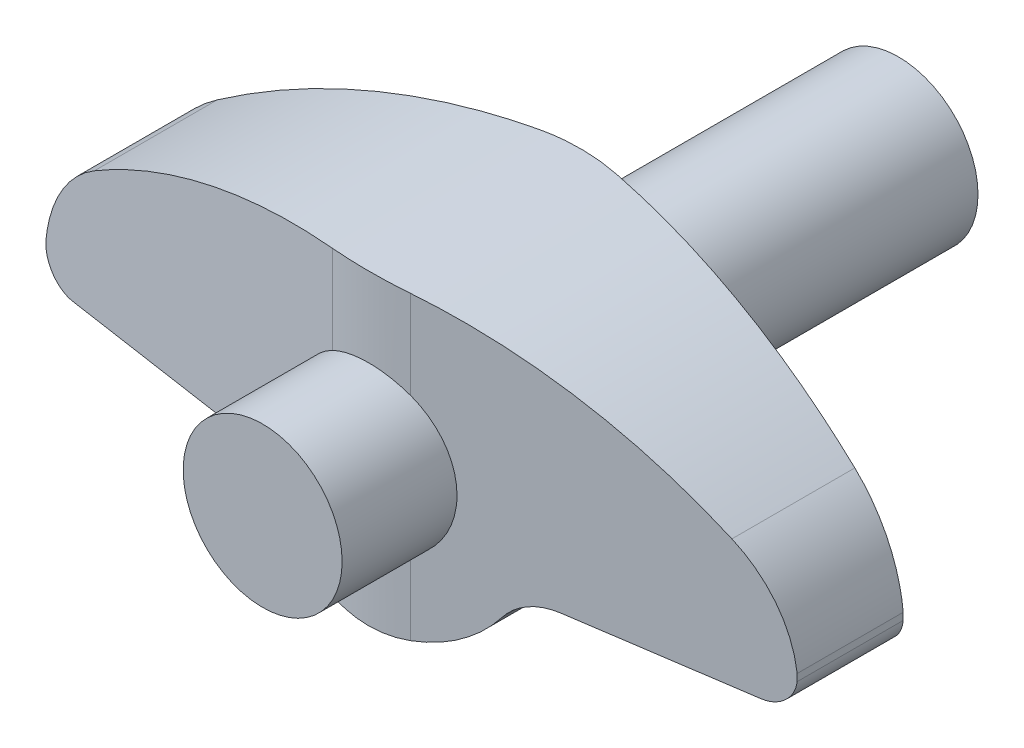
ISO-10303-21;
HEADER;
FILE_DESCRIPTION(('STEP AP214'),'2;1');
FILE_NAME('part.step','',(''),(''),'','','');
FILE_SCHEMA(('AUTOMOTIVE_DESIGN { 1 0 10303 214 1 1 1 1 }'));
ENDSEC;
DATA;
#1=APPLICATION_CONTEXT('core data for automotive mechanical design processes');
#2=APPLICATION_PROTOCOL_DEFINITION('international standard','automotive_design',2000,#1);
#3=PRODUCT_CONTEXT('',#1,'mechanical');
#4=PRODUCT('Part','Part','',(#3));
#5=PRODUCT_RELATED_PRODUCT_CATEGORY('part','',(#4));
#6=PRODUCT_DEFINITION_FORMATION('','',#4);
#7=PRODUCT_DEFINITION_CONTEXT('part definition',#1,'design');
#8=PRODUCT_DEFINITION('design','',#6,#7);
#9=PRODUCT_DEFINITION_SHAPE('','',#8);
#10=(LENGTH_UNIT() NAMED_UNIT(*) SI_UNIT(.MILLI.,.METRE.));
#11=(NAMED_UNIT(*) PLANE_ANGLE_UNIT() SI_UNIT($,.RADIAN.));
#12=(NAMED_UNIT(*) SI_UNIT($,.STERADIAN.) SOLID_ANGLE_UNIT());
#13=UNCERTAINTY_MEASURE_WITH_UNIT(LENGTH_MEASURE(1.E-05),#10,'distance_accuracy_value','');
#14=(GEOMETRIC_REPRESENTATION_CONTEXT(3) GLOBAL_UNCERTAINTY_ASSIGNED_CONTEXT((#13)) GLOBAL_UNIT_ASSIGNED_CONTEXT((#10,
#11,#12)) REPRESENTATION_CONTEXT('',''));
#15=CARTESIAN_POINT('',(0.,0.,0.));
#16=DIRECTION('',(0.,0.,1.));
#17=DIRECTION('',(1.,0.,0.));
#18=AXIS2_PLACEMENT_3D('',#15,#16,#17);
#19=CARTESIAN_POINT('',(20.32,-7.62,-12.7));
#20=DIRECTION('',(0.,-1.,0.));
#21=DIRECTION('',(0.,0.,-1.));
#22=AXIS2_PLACEMENT_3D('',#19,#20,#21);
#23=PLANE('',#22);
#24=DIRECTION('',(0.,0.,1.));
#25=VECTOR('',#24,1.);
#26=CARTESIAN_POINT('',(20.32,-7.62,-12.7));
#27=LINE('',#26,#25);
#28=CARTESIAN_POINT('',(20.32,-7.62,-10.0251985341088));
#29=VERTEX_POINT('',#28);
#30=CARTESIAN_POINT('',(20.32,-7.62,10.0251985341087));
#31=VERTEX_POINT('',#30);
#32=EDGE_CURVE('E363',#29,#31,#27,.T.);
#33=ORIENTED_EDGE('',*,*,#32,.F.);
#34=DIRECTION('',(0.989102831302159,0.,0.147226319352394));
#35=VECTOR('',#34,1.);
#36=CARTESIAN_POINT('',(19.9304901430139,-7.62,-10.0831764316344));
#37=LINE('',#36,#35);
#38=CARTESIAN_POINT('',(41.2244844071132,-7.62,-6.91360062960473));
#39=VERTEX_POINT('',#38);
#40=EDGE_CURVE('E471',#29,#39,#37,.T.);
#41=ORIENTED_EDGE('',*,*,#40,.T.);
#42=DIRECTION('',(0.,0.,1.));
#43=VECTOR('',#42,1.);
#44=CARTESIAN_POINT('',(41.2244844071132,-7.62,-12.7));
#45=LINE('',#44,#43);
#46=CARTESIAN_POINT('',(41.2244844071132,-7.62,6.91360062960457));
#47=VERTEX_POINT('',#46);
#48=EDGE_CURVE('E356',#39,#47,#45,.T.);
#49=ORIENTED_EDGE('',*,*,#48,.T.);
#50=DIRECTION('',(-0.989102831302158,0.,0.147226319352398));
#51=VECTOR('',#50,1.);
#52=CARTESIAN_POINT('',(23.6292881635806,-7.62,9.53261646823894));
#53=LINE('',#52,#51);
#54=EDGE_CURVE('E530',#47,#31,#53,.T.);
#55=ORIENTED_EDGE('',*,*,#54,.T.);
#56=EDGE_LOOP('',(#33,#41,#49,#55));
#57=FACE_BOUND('',#56,.T.);
#58=DIRECTION('',(0.,0.,-1.));
#59=VECTOR('',#58,1.);
#60=CARTESIAN_POINT('',(25.4,-7.62,4.445));
#61=LINE('',#60,#59);
#62=CARTESIAN_POINT('',(25.4,-7.62,4.445));
#63=VERTEX_POINT('',#62);
#64=CARTESIAN_POINT('',(25.4,-7.62,-4.445));
#65=VERTEX_POINT('',#64);
#66=EDGE_CURVE('E234',#63,#65,#61,.T.);
#67=ORIENTED_EDGE('',*,*,#66,.F.);
#68=DIRECTION('',(-1.,0.,0.));
#69=VECTOR('',#68,1.);
#70=CARTESIAN_POINT('',(25.4,-7.62,4.445));
#71=LINE('',#70,#69);
#72=CARTESIAN_POINT('',(38.1,-7.62,4.445));
#73=VERTEX_POINT('',#72);
#74=EDGE_CURVE('E225',#73,#63,#71,.T.);
#75=ORIENTED_EDGE('',*,*,#74,.F.);
#76=DIRECTION('',(0.,0.,-1.));
#77=VECTOR('',#76,1.);
#78=CARTESIAN_POINT('',(38.1,-7.62,4.445));
#79=LINE('',#78,#77);
#80=CARTESIAN_POINT('',(38.1,-7.62,-4.445));
#81=VERTEX_POINT('',#80);
#82=EDGE_CURVE('E229',#73,#81,#79,.T.);
#83=ORIENTED_EDGE('',*,*,#82,.T.);
#84=DIRECTION('',(-1.,0.,0.));
#85=VECTOR('',#84,1.);
#86=CARTESIAN_POINT('',(25.4,-7.62,-4.445));
#87=LINE('',#86,#85);
#88=EDGE_CURVE('E226',#81,#65,#87,.T.);
#89=ORIENTED_EDGE('',*,*,#88,.T.);
#90=EDGE_LOOP('',(#67,#75,#83,#89));
#91=FACE_BOUND('',#90,.T.);
#92=ADVANCED_FACE('F33',(#57,#91),#23,.T.);
#93=CARTESIAN_POINT('',(0.,-38.1,19.0499999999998));
#94=DIRECTION('',(0.,1.,0.));
#95=DIRECTION('',(0.,0.,1.));
#96=AXIS2_PLACEMENT_3D('',#93,#94,#95);
#97=CYLINDRICAL_SURFACE('',#96,31.7499999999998);
#98=CARTESIAN_POINT('',(9.525,0.,-11.237569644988));
#99=CARTESIAN_POINT('',(9.52499948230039,-0.260977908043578,-11.2375700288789));
#100=CARTESIAN_POINT('',(9.51426505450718,-0.521964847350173,-11.240951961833));
#101=CARTESIAN_POINT('',(9.47142636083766,-1.04201132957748,-11.2543739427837));
#102=CARTESIAN_POINT('',(9.43932110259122,-1.30107078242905,-11.2644142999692));
#103=CARTESIAN_POINT('',(9.35402509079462,-1.81543990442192,-11.2908421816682));
#104=CARTESIAN_POINT('',(9.30082826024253,-2.07074847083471,-11.3072315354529));
#105=CARTESIAN_POINT('',(9.17382381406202,-2.57572661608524,-11.3458525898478));
#106=CARTESIAN_POINT('',(9.10001632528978,-2.82539622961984,-11.3680842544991));
#107=CARTESIAN_POINT('',(8.93257302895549,-3.31693406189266,-11.4176753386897));
#108=CARTESIAN_POINT('',(8.83897480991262,-3.5588160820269,-11.445025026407));
#109=CARTESIAN_POINT('',(8.63256983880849,-4.03378739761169,-11.5040955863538));
#110=CARTESIAN_POINT('',(8.51975599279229,-4.26687340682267,-11.535818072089));
#111=CARTESIAN_POINT('',(8.27578901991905,-4.72268541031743,-11.6027291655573));
#112=CARTESIAN_POINT('',(8.14463766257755,-4.94541240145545,-11.6379174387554));
#113=CARTESIAN_POINT('',(7.86488621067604,-5.37920116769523,-11.7108022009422));
#114=CARTESIAN_POINT('',(7.71628517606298,-5.59026231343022,-11.7484988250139));
#115=CARTESIAN_POINT('',(7.39810114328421,-6.00533515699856,-11.8264989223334));
#116=CARTESIAN_POINT('',(7.2280387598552,-6.20897129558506,-11.8668461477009));
#117=CARTESIAN_POINT('',(6.87158119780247,-6.60130649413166,-11.9480205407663));
#118=CARTESIAN_POINT('',(6.6851857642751,-6.79000532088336,-11.9888477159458));
#119=CARTESIAN_POINT('',(6.29721020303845,-7.15129644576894,-12.0698797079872));
#120=CARTESIAN_POINT('',(6.09562791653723,-7.32388644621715,-12.1100844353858));
#121=CARTESIAN_POINT('',(5.67856470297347,-7.65179010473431,-12.1887808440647));
#122=CARTESIAN_POINT('',(5.46308417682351,-7.80710426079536,-12.2272725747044));
#123=CARTESIAN_POINT('',(5.0149143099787,-8.10245508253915,-12.3022856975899));
#124=CARTESIAN_POINT('',(4.78195892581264,-8.24210326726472,-12.3387488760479));
#125=CARTESIAN_POINT('',(4.30461260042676,-8.50115561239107,-12.4077642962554));
#126=CARTESIAN_POINT('',(4.06022616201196,-8.62056765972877,-12.4403180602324));
#127=CARTESIAN_POINT('',(3.56161689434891,-8.83824124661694,-12.5006012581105));
#128=CARTESIAN_POINT('',(3.30739369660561,-8.93650199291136,-12.5283305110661));
#129=CARTESIAN_POINT('',(2.79096350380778,-9.11100585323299,-12.5781568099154));
#130=CARTESIAN_POINT('',(2.52875678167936,-9.18724971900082,-12.6002540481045));
#131=CARTESIAN_POINT('',(2.00592443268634,-9.31516166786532,-12.6376234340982));
#132=CARTESIAN_POINT('',(1.74546810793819,-9.3674703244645,-12.6530727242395));
#133=CARTESIAN_POINT('',(1.2208017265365,-9.45017414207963,-12.6776078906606));
#134=CARTESIAN_POINT('',(0.956591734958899,-9.48056968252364,-12.6866938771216));
#135=CARTESIAN_POINT('',(0.426458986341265,-9.5191584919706,-12.6982426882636));
#136=CARTESIAN_POINT('',(0.160536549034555,-9.52735579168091,-12.7007067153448));
#137=CARTESIAN_POINT('',(-0.37103743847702,-9.52148116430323,-12.6989443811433));
#138=CARTESIAN_POINT('',(-0.63668899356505,-9.50740964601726,-12.6947181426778));
#139=CARTESIAN_POINT('',(-1.15725347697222,-9.45793616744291,-12.6799369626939));
#140=CARTESIAN_POINT('',(-1.41223865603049,-9.42322890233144,-12.669588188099));
#141=CARTESIAN_POINT('',(-1.9182629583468,-9.33337684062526,-12.6430111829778));
#142=CARTESIAN_POINT('',(-2.16930218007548,-9.27823255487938,-12.6267830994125));
#143=CARTESIAN_POINT('',(-2.66568273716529,-9.14798303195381,-12.5888778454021));
#144=CARTESIAN_POINT('',(-2.91102488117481,-9.0728806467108,-12.5672014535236));
#145=CARTESIAN_POINT('',(-3.39451680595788,-8.90328813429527,-12.5189532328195));
#146=CARTESIAN_POINT('',(-3.63266383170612,-8.80879068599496,-12.4923795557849));
#147=CARTESIAN_POINT('',(-4.10278596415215,-8.59998080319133,-12.4347005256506));
#148=CARTESIAN_POINT('',(-4.33466146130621,-8.4854573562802,-12.403547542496));
#149=CARTESIAN_POINT('',(-4.78804107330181,-8.23814268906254,-12.337731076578));
#150=CARTESIAN_POINT('',(-5.00954131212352,-8.10534471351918,-12.3030662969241));
#151=CARTESIAN_POINT('',(-5.44069606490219,-7.82246237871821,-12.2311299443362));
#152=CARTESIAN_POINT('',(-5.65035299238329,-7.67238156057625,-12.1938589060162));
#153=CARTESIAN_POINT('',(-6.05672299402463,-7.35582098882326,-12.1176334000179));
#154=CARTESIAN_POINT('',(-6.2534300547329,-7.18933370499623,-12.0786781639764));
#155=CARTESIAN_POINT('',(-6.63996459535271,-6.83432390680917,-11.9985719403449));
#156=CARTESIAN_POINT('',(-6.82923371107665,-6.64519900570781,-11.9573942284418));
#157=CARTESIAN_POINT('',(-7.19115988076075,-6.25174107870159,-11.8754610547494));
#158=CARTESIAN_POINT('',(-7.3638239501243,-6.04741454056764,-11.8347054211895));
#159=CARTESIAN_POINT('',(-7.69157896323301,-5.62466081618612,-11.7547170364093));
#160=CARTESIAN_POINT('',(-7.84666057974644,-5.40622624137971,-11.7154851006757));
#161=CARTESIAN_POINT('',(-8.13800662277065,-4.9568290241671,-11.6397051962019));
#162=CARTESIAN_POINT('',(-8.27427848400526,-4.72587138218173,-11.6031561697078));
#163=CARTESIAN_POINT('',(-8.52833887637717,-4.25046177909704,-11.5334509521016));
#164=CARTESIAN_POINT('',(-8.64592783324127,-4.00589750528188,-11.5003325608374));
#165=CARTESIAN_POINT('',(-8.85995065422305,-3.5072056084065,-11.4389516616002));
#166=CARTESIAN_POINT('',(-8.9563931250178,-3.25308192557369,-11.4106871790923));
#167=CARTESIAN_POINT('',(-9.12733705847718,-2.73701011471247,-11.3599026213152));
#168=CARTESIAN_POINT('',(-9.20183980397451,-2.47506244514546,-11.3373822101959));
#169=CARTESIAN_POINT('',(-9.32821473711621,-1.94529712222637,-11.2988267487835));
#170=CARTESIAN_POINT('',(-9.38008783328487,-1.67747970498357,-11.2827914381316));
#171=CARTESIAN_POINT('',(-9.4591946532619,-1.14812437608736,-11.2582131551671));
#172=CARTESIAN_POINT('',(-9.48727497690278,-0.886724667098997,-11.2494131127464));
#173=CARTESIAN_POINT('',(-9.52173042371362,-0.362360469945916,-11.2386031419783));
#174=CARTESIAN_POINT('',(-9.52810608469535,-0.0993960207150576,-11.2365930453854));
#175=CARTESIAN_POINT('',(-9.51909246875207,0.426087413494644,-11.2394271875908));
#176=CARTESIAN_POINT('',(-9.5037059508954,0.6886064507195,-11.2442705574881));
#177=CARTESIAN_POINT('',(-9.45131946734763,1.2112649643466,-11.2606550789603));
#178=CARTESIAN_POINT('',(-9.41431968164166,1.47140446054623,-11.2721961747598));
#179=CARTESIAN_POINT('',(-9.32030296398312,1.98061832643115,-11.301224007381));
#180=CARTESIAN_POINT('',(-9.26383636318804,2.22980397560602,-11.3185469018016));
#181=CARTESIAN_POINT('',(-9.13119213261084,2.72251130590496,-11.3586933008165));
#182=CARTESIAN_POINT('',(-9.05500746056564,2.96603092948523,-11.3815187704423));
#183=CARTESIAN_POINT('',(-8.88357103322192,3.44566943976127,-11.4320051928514));
#184=CARTESIAN_POINT('',(-8.78832412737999,3.6817901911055,-11.4596649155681));
#185=CARTESIAN_POINT('',(-8.57943028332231,4.14531698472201,-11.5190638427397));
#186=CARTESIAN_POINT('',(-8.46577627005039,4.37271963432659,-11.5508046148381));
#187=CARTESIAN_POINT('',(-8.21765625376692,4.82323731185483,-11.6183808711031));
#188=CARTESIAN_POINT('',(-8.08271970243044,5.04608029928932,-11.6543023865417));
#189=CARTESIAN_POINT('',(-7.79520412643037,5.47979424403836,-11.7285532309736));
#190=CARTESIAN_POINT('',(-7.64261717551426,5.69065975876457,-11.7668836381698));
#191=CARTESIAN_POINT('',(-7.320846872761,6.09904946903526,-11.8449040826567));
#192=CARTESIAN_POINT('',(-7.15166367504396,6.29657378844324,-11.884594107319));
#193=CARTESIAN_POINT('',(-6.79775332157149,6.67710207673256,-11.964286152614));
#194=CARTESIAN_POINT('',(-6.61302590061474,6.86010579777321,-12.0042881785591));
#195=CARTESIAN_POINT('',(-6.22184315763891,7.21713588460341,-12.0850693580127));
#196=CARTESIAN_POINT('',(-6.014828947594,7.39055693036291,-12.1258202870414));
#197=CARTESIAN_POINT('',(-5.58666887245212,7.71929906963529,-12.2053838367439));
#198=CARTESIAN_POINT('',(-5.3655282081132,7.87462676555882,-12.244197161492));
#199=CARTESIAN_POINT('',(-4.91039705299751,8.16619179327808,-12.3188330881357));
#200=CARTESIAN_POINT('',(-4.67640180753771,8.3024219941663,-12.3546545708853));
#201=CARTESIAN_POINT('',(-4.19729823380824,8.55462245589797,-12.4222684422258));
#202=CARTESIAN_POINT('',(-3.95219455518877,8.67060109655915,-12.4540624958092));
#203=CARTESIAN_POINT('',(-3.4543347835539,8.88063325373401,-12.512516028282));
#204=CARTESIAN_POINT('',(-3.20164883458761,8.97484283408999,-12.5392118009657));
#205=CARTESIAN_POINT('',(-2.68870958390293,9.14161867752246,-12.5869985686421));
#206=CARTESIAN_POINT('',(-2.42845628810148,9.21418495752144,-12.608089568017));
#207=CARTESIAN_POINT('',(-1.90237524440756,9.33699824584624,-12.6440524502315));
#208=CARTESIAN_POINT('',(-1.63654883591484,9.38725055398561,-12.6589258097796));
#209=CARTESIAN_POINT('',(-1.10130355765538,9.46498178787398,-12.682024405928));
#210=CARTESIAN_POINT('',(-0.831884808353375,9.49246147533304,-12.6902498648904));
#211=CARTESIAN_POINT('',(-0.301987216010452,9.52376692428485,-12.699626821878));
#212=CARTESIAN_POINT('',(-0.0415640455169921,9.52846356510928,-12.7010387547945));
#213=CARTESIAN_POINT('',(0.478743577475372,9.51651934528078,-12.6974562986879));
#214=CARTESIAN_POINT('',(0.738628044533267,9.49987906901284,-12.6924620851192));
#215=CARTESIAN_POINT('',(1.25595040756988,9.44541472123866,-12.6762046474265));
#216=CARTESIAN_POINT('',(1.5133884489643,9.40759191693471,-12.6649417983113));
#217=CARTESIAN_POINT('',(2.02399009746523,9.311100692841,-12.6364537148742));
#218=CARTESIAN_POINT('',(2.27715368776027,9.25243219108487,-12.6192284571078));
#219=CARTESIAN_POINT('',(2.77469244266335,9.11551158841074,-12.5794986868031));
#220=CARTESIAN_POINT('',(3.01913354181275,9.03748132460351,-12.5570541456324));
#221=CARTESIAN_POINT('',(3.50058366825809,8.86212167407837,-12.5073605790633));
#222=CARTESIAN_POINT('',(3.73758999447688,8.76478536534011,-12.4801098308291));
#223=CARTESIAN_POINT('',(4.20255973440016,8.55158037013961,-12.4215093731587));
#224=CARTESIAN_POINT('',(4.4305238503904,8.43571312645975,-12.3901599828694));
#225=CARTESIAN_POINT('',(4.87605220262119,8.18626455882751,-12.3241508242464));
#226=CARTESIAN_POINT('',(5.09361583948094,8.05268221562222,-12.2894908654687));
#227=CARTESIAN_POINT('',(5.52382659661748,7.76415951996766,-12.2165788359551));
#228=CARTESIAN_POINT('',(5.73609387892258,7.60867268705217,-12.1782473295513));
#229=CARTESIAN_POINT('',(6.1468714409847,7.28084158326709,-12.0999951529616));
#230=CARTESIAN_POINT('',(6.3453814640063,7.10849699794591,-12.0600744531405));
#231=CARTESIAN_POINT('',(6.72748367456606,6.7480067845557,-11.9796889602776));
#232=CARTESIAN_POINT('',(6.91107165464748,6.55985673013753,-11.9392240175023));
#233=CARTESIAN_POINT('',(7.26212371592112,6.16897012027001,-11.8588416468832));
#234=CARTESIAN_POINT('',(7.42958803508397,5.9662337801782,-11.8189242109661));
#235=CARTESIAN_POINT('',(7.75210301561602,5.54110383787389,-11.7395405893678));
#236=CARTESIAN_POINT('',(7.90662893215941,5.31830244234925,-11.7001240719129));
#237=CARTESIAN_POINT('',(8.19627038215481,4.860063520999,-11.624192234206));
#238=CARTESIAN_POINT('',(8.33139293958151,4.62463061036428,-11.5876758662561));
#239=CARTESIAN_POINT('',(8.58123221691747,4.14267287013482,-11.5186400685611));
#240=CARTESIAN_POINT('',(8.69595322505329,3.89615038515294,-11.4861197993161));
#241=CARTESIAN_POINT('',(8.90406957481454,3.39368482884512,-11.4260855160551));
#242=CARTESIAN_POINT('',(8.99746702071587,3.13774268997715,-11.3985710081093));
#243=CARTESIAN_POINT('',(9.15321283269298,2.64638955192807,-11.3520897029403));
#244=CARTESIAN_POINT('',(9.21782646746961,2.41175084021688,-11.3325203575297));
#245=CARTESIAN_POINT('',(9.32898362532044,1.93777044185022,-11.2985741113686));
#246=CARTESIAN_POINT('',(9.37552125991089,1.69842724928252,-11.2841989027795));
#247=CARTESIAN_POINT('',(9.45012182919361,1.21664775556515,-11.2610413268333));
#248=CARTESIAN_POINT('',(9.47818769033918,0.974211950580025,-11.252258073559));
#249=CARTESIAN_POINT('',(9.51562356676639,0.487853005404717,-11.2405231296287));
#250=CARTESIAN_POINT('',(9.52500048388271,0.243930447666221,-11.2375692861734));
#251=CARTESIAN_POINT('',(9.525,0.,-11.237569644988));
#252=B_SPLINE_CURVE_WITH_KNOTS('',3,(#98,#99,#100,#101,#102,#103,#104,#105,#106,#107,#108,#109,
#110,#111,#112,#113,#114,#115,#116,#117,#118,#119,#120,#121,#122,#123,#124,#125,#126,#127,#128,
#129,#130,#131,#132,#133,#134,#135,#136,#137,#138,#139,#140,#141,#142,#143,#144,#145,#146,#147,
#148,#149,#150,#151,#152,#153,#154,#155,#156,#157,#158,#159,#160,#161,#162,#163,#164,#165,#166,
#167,#168,#169,#170,#171,#172,#173,#174,#175,#176,#177,#178,#179,#180,#181,#182,#183,#184,#185,
#186,#187,#188,#189,#190,#191,#192,#193,#194,#195,#196,#197,#198,#199,#200,#201,#202,#203,#204,
#205,#206,#207,#208,#209,#210,#211,#212,#213,#214,#215,#216,#217,#218,#219,#220,#221,#222,#223,
#224,#225,#226,#227,#228,#229,#230,#231,#232,#233,#234,#235,#236,#237,#238,#239,#240,#241,#242,
#243,#244,#245,#246,#247,#248,#249,#250,#251),.UNSPECIFIED.,.T.,.F.,(4,2,2,2,2,2,2,2,2,2,2,2,2,
2,2,2,2,2,2,2,2,2,2,2,2,2,2,2,2,2,2,2,2,2,2,2,2,2,2,2,2,2,2,2,2,2,2,2,2,2,2,2,2,2,2,2,2,2,2,2,2,
2,2,2,2,2,2,2,2,2,2,2,2,2,2,2,4),(0.,0.782707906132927,1.56545216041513,2.34842210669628,
3.13138723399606,3.91287842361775,4.69465874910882,5.47636368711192,6.25811075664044,
7.06226912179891,7.86644003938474,8.67072548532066,9.47498774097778,10.2961085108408,
11.1169085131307,11.937739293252,12.7585420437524,13.5558669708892,14.3531780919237,
15.1503444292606,15.9474961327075,16.7192210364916,17.4909266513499,18.2625220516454,
19.0344092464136,19.81498251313,20.5958451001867,21.3765479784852,22.1576108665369,
22.9688131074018,23.7796711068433,24.5909572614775,25.4019218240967,26.2210386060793,
27.0398213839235,27.8585562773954,28.6772582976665,29.4654336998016,30.2535895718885,
31.041645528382,31.8296949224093,32.597080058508,33.3647396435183,34.1322041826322,
34.8999644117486,35.688010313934,36.4764114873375,37.2648053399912,38.0532126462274,
38.8715767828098,39.689641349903,40.5080105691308,41.326040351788,42.1380098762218,
42.9499787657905,43.7617547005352,44.5735034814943,45.3539646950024,46.1344045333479,
46.9147976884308,47.6951939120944,48.4670312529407,49.2391458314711,50.0112003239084,
50.7832992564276,51.5800940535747,52.3769037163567,53.173937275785,53.9709590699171,
54.7919488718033,55.6126407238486,56.4331598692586,57.2535980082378,57.9853264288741,
58.7172930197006,59.4491436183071,60.1807238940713),.UNSPECIFIED.);
#253=CARTESIAN_POINT('',(4.67443563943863,-8.29911299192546,-12.3540148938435));
#254=VERTEX_POINT('',#253);
#255=CARTESIAN_POINT('',(-4.67443563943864,-8.29911299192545,-12.3540148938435));
#256=VERTEX_POINT('',#255);
#257=EDGE_CURVE('E280',#254,#256,#252,.T.);
#258=ORIENTED_EDGE('',*,*,#257,.F.);
#259=DIRECTION('',(0.,1.,0.));
#260=VECTOR('',#259,1.);
#261=CARTESIAN_POINT('',(4.67443563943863,-38.1,-12.3540148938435));
#262=LINE('',#261,#260);
#263=CARTESIAN_POINT('',(4.67443563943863,-17.1545344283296,-12.3540148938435));
#264=VERTEX_POINT('',#263);
#265=EDGE_CURVE('E404',#264,#254,#262,.T.);
#266=ORIENTED_EDGE('',*,*,#265,.F.);
#267=CARTESIAN_POINT('',(17.78,0.,-7.25464027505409));
#268=CARTESIAN_POINT('',(17.7800073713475,0.454181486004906,-7.25463010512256));
#269=CARTESIAN_POINT('',(17.7625781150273,0.908288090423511,-7.26644004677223));
#270=CARTESIAN_POINT('',(17.6931580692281,1.81280940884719,-7.31316484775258));
#271=CARTESIAN_POINT('',(17.6411570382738,2.26322298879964,-7.34808655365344));
#272=CARTESIAN_POINT('',(17.503298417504,3.15718763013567,-7.43969323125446));
#273=CARTESIAN_POINT('',(17.4173943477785,3.60072839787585,-7.49640807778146));
#274=CARTESIAN_POINT('',(17.2129575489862,4.47716288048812,-7.62941955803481));
#275=CARTESIAN_POINT('',(17.0944262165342,4.91005705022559,-7.70571535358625));
#276=CARTESIAN_POINT('',(16.8270791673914,5.75976398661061,-7.87464859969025));
#277=CARTESIAN_POINT('',(16.6784715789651,6.17666503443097,-7.9671731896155));
#278=CARTESIAN_POINT('',(16.3519157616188,6.99554480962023,-8.16605935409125));
#279=CARTESIAN_POINT('',(16.1739566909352,7.39751795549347,-8.27242603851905));
#280=CARTESIAN_POINT('',(15.7901950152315,8.18473495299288,-8.49598933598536));
#281=CARTESIAN_POINT('',(15.58439470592,8.56998018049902,-8.61318505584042));
#282=CARTESIAN_POINT('',(15.1462746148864,9.32246412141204,-8.85547484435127));
#283=CARTESIAN_POINT('',(14.913953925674,9.68970221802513,-8.98056918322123));
#284=CARTESIAN_POINT('',(14.3981912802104,10.4427051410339,-9.24925403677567));
#285=CARTESIAN_POINT('',(14.1119422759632,10.8263496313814,-9.39340524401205));
#286=CARTESIAN_POINT('',(13.5100792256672,11.5686839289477,-9.68415965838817));
#287=CARTESIAN_POINT('',(13.1944719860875,11.9273794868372,-9.83076229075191));
#288=CARTESIAN_POINT('',(12.5349598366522,12.6186983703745,-10.1230604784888));
#289=CARTESIAN_POINT('',(12.1910345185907,12.9513025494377,-10.2687552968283));
#290=CARTESIAN_POINT('',(11.4764550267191,13.5885455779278,-10.5557721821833));
#291=CARTESIAN_POINT('',(11.1057997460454,13.8931832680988,-10.697094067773));
#292=CARTESIAN_POINT('',(10.3046405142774,14.4988669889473,-10.9845451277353));
#293=CARTESIAN_POINT('',(9.87175367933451,14.7971121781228,-11.1299587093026));
#294=CARTESIAN_POINT('',(8.97815687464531,15.3557396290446,-11.4077430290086));
#295=CARTESIAN_POINT('',(8.51744479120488,15.6161190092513,-11.5401127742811));
#296=CARTESIAN_POINT('',(7.57123822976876,16.096148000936,-11.7879286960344));
#297=CARTESIAN_POINT('',(7.08575888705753,16.3158221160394,-11.9033850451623));
#298=CARTESIAN_POINT('',(6.09320378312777,16.7118714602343,-12.1139631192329));
#299=CARTESIAN_POINT('',(5.58613103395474,16.8882527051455,-12.2090876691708));
#300=CARTESIAN_POINT('',(4.59872179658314,17.1820347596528,-12.3688251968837));
#301=CARTESIAN_POINT('',(4.11981141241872,17.3031915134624,-12.4353527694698));
#302=CARTESIAN_POINT('',(3.15114918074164,17.5055248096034,-12.5469992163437));
#303=CARTESIAN_POINT('',(2.66139790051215,17.5867034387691,-12.5921192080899));
#304=CARTESIAN_POINT('',(1.67559249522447,17.7078303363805,-12.6596014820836));
#305=CARTESIAN_POINT('',(1.17954277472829,17.7478059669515,-12.6819788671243));
#306=CARTESIAN_POINT('',(0.185351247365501,17.785990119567,-12.7033506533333));
#307=CARTESIAN_POINT('',(-0.312790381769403,17.784202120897,-12.7023470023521));
#308=CARTESIAN_POINT('',(-1.25254177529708,17.7413694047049,-12.6783793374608));
#309=CARTESIAN_POINT('',(-1.69441609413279,17.7046088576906,-12.6578119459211));
#310=CARTESIAN_POINT('',(-2.57296108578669,17.5984093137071,-12.5986359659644));
#311=CARTESIAN_POINT('',(-3.00963221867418,17.5289732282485,-12.5600289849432));
#312=CARTESIAN_POINT('',(-3.87481116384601,17.3582456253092,-12.4656744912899));
#313=CARTESIAN_POINT('',(-4.30331867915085,17.2569529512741,-12.4099263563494));
#314=CARTESIAN_POINT('',(-5.14946046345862,17.023632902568,-12.282549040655));
#315=CARTESIAN_POINT('',(-5.56709430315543,16.8916043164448,-12.2109192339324));
#316=CARTESIAN_POINT('',(-6.3931351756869,16.5967000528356,-12.0525550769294));
#317=CARTESIAN_POINT('',(-6.80141103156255,16.4335337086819,-11.9656790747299));
#318=CARTESIAN_POINT('',(-7.60232702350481,16.0787090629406,-11.7791455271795));
#319=CARTESIAN_POINT('',(-7.99496724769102,15.8870509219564,-11.679488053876));
#320=CARTESIAN_POINT('',(-8.76292832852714,15.4767265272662,-11.4693726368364));
#321=CARTESIAN_POINT('',(-9.1382460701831,15.2580554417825,-11.358912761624));
#322=CARTESIAN_POINT('',(-9.87004323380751,14.7952062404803,-11.1293281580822));
#323=CARTESIAN_POINT('',(-10.2265208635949,14.5510257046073,-11.0102026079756));
#324=CARTESIAN_POINT('',(-10.9576145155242,14.0102814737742,-10.7520062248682));
#325=CARTESIAN_POINT('',(-11.3298918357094,13.7109106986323,-10.6121849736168));
#326=CARTESIAN_POINT('',(-12.048178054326,13.0842278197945,-10.3277663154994));
#327=CARTESIAN_POINT('',(-12.3941852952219,12.7569139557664,-10.183168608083));
#328=CARTESIAN_POINT('',(-13.058900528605,12.075605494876,-9.89234533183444));
#329=CARTESIAN_POINT('',(-13.3775803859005,11.721584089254,-9.74611825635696));
#330=CARTESIAN_POINT('',(-13.9858943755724,10.9886305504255,-9.4556290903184));
#331=CARTESIAN_POINT('',(-14.2755271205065,10.6096972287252,-9.31136709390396));
#332=CARTESIAN_POINT('',(-14.8499126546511,9.79187960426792,-9.01521870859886));
#333=CARTESIAN_POINT('',(-15.1316899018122,9.3507002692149,-8.86387642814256));
#334=CARTESIAN_POINT('',(-15.6567033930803,8.4422319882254,-8.57282169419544));
#335=CARTESIAN_POINT('',(-15.8999362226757,7.97494073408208,-8.43311027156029));
#336=CARTESIAN_POINT('',(-16.3452641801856,7.01707885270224,-8.17061036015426));
#337=CARTESIAN_POINT('',(-16.5473969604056,6.526530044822,-8.04780641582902));
#338=CARTESIAN_POINT('',(-16.9082112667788,5.52485486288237,-7.82415184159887));
#339=CARTESIAN_POINT('',(-17.0668999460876,5.01373189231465,-7.72329759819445));
#340=CARTESIAN_POINT('',(-17.3274414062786,4.01647992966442,-7.55534462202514));
#341=CARTESIAN_POINT('',(-17.4328246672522,3.53162119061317,-7.48619135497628));
#342=CARTESIAN_POINT('',(-17.6029432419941,2.55184550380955,-7.37365161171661));
#343=CARTESIAN_POINT('',(-17.6676812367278,2.05692922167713,-7.33026343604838));
#344=CARTESIAN_POINT('',(-17.7552513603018,1.06227684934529,-7.271404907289));
#345=CARTESIAN_POINT('',(-17.7781287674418,0.562546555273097,-7.25590438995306));
#346=CARTESIAN_POINT('',(-17.7816499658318,-0.43710150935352,-7.25352571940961));
#347=CARTESIAN_POINT('',(-17.7622988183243,-0.937019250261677,-7.26664413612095));
#348=CARTESIAN_POINT('',(-17.6879721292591,-1.85541962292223,-7.31663969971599));
#349=CARTESIAN_POINT('',(-17.6389243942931,-2.27461727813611,-7.34955843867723));
#350=CARTESIAN_POINT('',(-17.5115601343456,-3.10655707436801,-7.43421447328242));
#351=CARTESIAN_POINT('',(-17.4332472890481,-3.51930002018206,-7.48594940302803));
#352=CARTESIAN_POINT('',(-17.2482805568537,-4.33596740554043,-7.60654655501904));
#353=CARTESIAN_POINT('',(-17.1416157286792,-4.73988837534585,-7.67541538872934));
#354=CARTESIAN_POINT('',(-16.9011012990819,-5.53663912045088,-7.82816114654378));
#355=CARTESIAN_POINT('',(-16.767249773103,-5.92946810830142,-7.91203913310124));
#356=CARTESIAN_POINT('',(-16.4676847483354,-6.71778469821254,-8.09608570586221));
#357=CARTESIAN_POINT('',(-16.3009081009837,-7.11274625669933,-8.19677299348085));
#358=CARTESIAN_POINT('',(-15.9405414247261,-7.88733816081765,-8.4091584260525));
#359=CARTESIAN_POINT('',(-15.7469404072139,-8.26696214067,-8.52086107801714));
#360=CARTESIAN_POINT('',(-15.3342069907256,-9.00949225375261,-8.75252852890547));
#361=CARTESIAN_POINT('',(-15.1150708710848,-9.37239593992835,-8.87249453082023));
#362=CARTESIAN_POINT('',(-14.6524310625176,-10.0803526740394,-9.11802007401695));
#363=CARTESIAN_POINT('',(-14.4089251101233,-10.4254040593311,-9.24358013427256));
#364=CARTESIAN_POINT('',(-13.8563342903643,-11.1522134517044,-9.5187740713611));
#365=CARTESIAN_POINT('',(-13.5430660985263,-11.5305938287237,-9.66895269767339));
#366=CARTESIAN_POINT('',(-12.8863628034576,-12.2601373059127,-9.96955514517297));
#367=CARTESIAN_POINT('',(-12.5429248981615,-12.6112978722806,-10.1199789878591));
#368=CARTESIAN_POINT('',(-11.827129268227,-13.2849192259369,-10.4174703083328));
#369=CARTESIAN_POINT('',(-11.4547526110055,-13.6073609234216,-10.5645355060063));
#370=CARTESIAN_POINT('',(-10.6828617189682,-14.2213945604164,-10.8516474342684));
#371=CARTESIAN_POINT('',(-10.2833489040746,-14.5129881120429,-10.9916945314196));
#372=CARTESIAN_POINT('',(-9.43552303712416,-15.0789106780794,-11.2690268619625));
#373=CARTESIAN_POINT('',(-8.98572740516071,-15.3513234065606,-11.4057052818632));
#374=CARTESIAN_POINT('',(-8.0602516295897,-15.8568197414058,-11.6636056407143));
#375=CARTESIAN_POINT('',(-7.58456996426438,-16.0899010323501,-11.7848266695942));
#376=CARTESIAN_POINT('',(-6.61088564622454,-16.513820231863,-12.0081377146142));
#377=CARTESIAN_POINT('',(-6.11290259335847,-16.7046943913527,-12.1102441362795));
#378=CARTESIAN_POINT('',(-5.09812851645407,-17.0418073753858,-12.2922580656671));
#379=CARTESIAN_POINT('',(-4.58134041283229,-17.1880530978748,-12.3721690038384));
#380=CARTESIAN_POINT('',(-3.58778043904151,-17.4209363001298,-12.5001933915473));
#381=CARTESIAN_POINT('',(-3.11239666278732,-17.5121738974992,-12.5507404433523));
#382=CARTESIAN_POINT('',(-2.15401193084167,-17.6556884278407,-12.6304964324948));
#383=CARTESIAN_POINT('',(-1.67101150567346,-17.7079680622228,-12.6597068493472));
#384=CARTESIAN_POINT('',(-0.701753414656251,-17.7727814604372,-12.6959468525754));
#385=CARTESIAN_POINT('',(-0.215497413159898,-17.7853341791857,-12.7029870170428));
#386=CARTESIAN_POINT('',(0.756203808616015,-17.7705547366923,-12.6947108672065));
#387=CARTESIAN_POINT('',(1.24164907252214,-17.7432247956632,-12.6793957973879));
#388=CARTESIAN_POINT('',(2.16174174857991,-17.6535635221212,-12.6293496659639));
#389=CARTESIAN_POINT('',(2.59684965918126,-17.5947885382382,-12.5965927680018));
#390=CARTESIAN_POINT('',(3.45991016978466,-17.4456061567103,-12.5138941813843));
#391=CARTESIAN_POINT('',(3.88786333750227,-17.3552012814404,-12.4639538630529));
#392=CARTESIAN_POINT('',(4.73391318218,-17.1437634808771,-12.3480081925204));
#393=CARTESIAN_POINT('',(5.15200930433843,-17.0227288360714,-12.2820019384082));
#394=CARTESIAN_POINT('',(5.9759061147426,-16.7512714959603,-12.1353516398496));
#395=CARTESIAN_POINT('',(6.3817062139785,-16.60084739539,-12.054706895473));
#396=CARTESIAN_POINT('',(7.19151937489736,-16.2667861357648,-11.8776855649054));
#397=CARTESIAN_POINT('',(7.59506912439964,-16.0822482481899,-11.7808917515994));
#398=CARTESIAN_POINT('',(8.38487680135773,-15.6849506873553,-11.5755263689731));
#399=CARTESIAN_POINT('',(8.77113456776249,-15.4721907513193,-11.4669546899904));
#400=CARTESIAN_POINT('',(9.52483224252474,-15.0199590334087,-11.2401797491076));
#401=CARTESIAN_POINT('',(9.89226752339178,-14.7804807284,-11.1219741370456));
#402=CARTESIAN_POINT('',(10.6068874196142,-14.2763299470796,-10.8782309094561));
#403=CARTESIAN_POINT('',(10.9540698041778,-14.0116547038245,-10.7526924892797));
#404=CARTESIAN_POINT('',(11.6665439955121,-13.4259845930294,-10.48161137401));
#405=CARTESIAN_POINT('',(12.029169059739,-13.1020264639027,-10.3354515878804));
#406=CARTESIAN_POINT('',(12.7261567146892,-12.4261431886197,-10.0403882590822));
#407=CARTESIAN_POINT('',(13.0605171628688,-12.0742159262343,-9.89148450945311));
#408=CARTESIAN_POINT('',(13.6999417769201,-11.3435430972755,-9.5943456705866));
#409=CARTESIAN_POINT('',(14.0049682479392,-10.9647640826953,-9.44611166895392));
#410=CARTESIAN_POINT('',(14.5837294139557,-10.1823389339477,-9.15429720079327));
#411=CARTESIAN_POINT('',(14.8574652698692,-9.77869372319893,-9.01071656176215));
#412=CARTESIAN_POINT('',(15.3911715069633,-8.91715843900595,-8.7218048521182));
#413=CARTESIAN_POINT('',(15.6486043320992,-8.45746667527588,-8.57713766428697));
#414=CARTESIAN_POINT('',(16.1232150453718,-7.5132907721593,-8.30287228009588));
#415=CARTESIAN_POINT('',(16.3403858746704,-7.02880230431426,-8.17327672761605));
#416=CARTESIAN_POINT('',(16.7313586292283,-6.03922424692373,-7.93474588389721));
#417=CARTESIAN_POINT('',(16.9052756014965,-5.53419355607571,-7.8257559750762));
#418=CARTESIAN_POINT('',(17.2077955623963,-4.50632316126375,-7.6330750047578));
#419=CARTESIAN_POINT('',(17.3364266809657,-3.98349473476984,-7.54936824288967));
#420=CARTESIAN_POINT('',(17.5532289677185,-2.88868398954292,-7.40684744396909));
#421=CARTESIAN_POINT('',(17.6380820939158,-2.31576626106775,-7.35009563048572));
#422=CARTESIAN_POINT('',(17.7514605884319,-1.16185775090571,-7.27400008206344));
#423=CARTESIAN_POINT('',(17.7799905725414,-0.58086763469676,-7.2546532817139));
#424=CARTESIAN_POINT('',(17.78,0.,-7.25464027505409));
#425=B_SPLINE_CURVE_WITH_KNOTS('',3,(#267,#268,#269,#270,#271,#272,#273,#274,#275,#276,#277,
#278,#279,#280,#281,#282,#283,#284,#285,#286,#287,#288,#289,#290,#291,#292,#293,#294,#295,#296,
#297,#298,#299,#300,#301,#302,#303,#304,#305,#306,#307,#308,#309,#310,#311,#312,#313,#314,#315,
#316,#317,#318,#319,#320,#321,#322,#323,#324,#325,#326,#327,#328,#329,#330,#331,#332,#333,#334,
#335,#336,#337,#338,#339,#340,#341,#342,#343,#344,#345,#346,#347,#348,#349,#350,#351,#352,#353,
#354,#355,#356,#357,#358,#359,#360,#361,#362,#363,#364,#365,#366,#367,#368,#369,#370,#371,#372,
#373,#374,#375,#376,#377,#378,#379,#380,#381,#382,#383,#384,#385,#386,#387,#388,#389,#390,#391,
#392,#393,#394,#395,#396,#397,#398,#399,#400,#401,#402,#403,#404,#405,#406,#407,#408,#409,#410,
#411,#412,#413,#414,#415,#416,#417,#418,#419,#420,#421,#422,#423,#424),.UNSPECIFIED.,.T.,.F.,(4,
2,2,2,2,2,2,2,2,2,2,2,2,2,2,2,2,2,2,2,2,2,2,2,2,2,2,2,2,2,2,2,2,2,2,2,2,2,2,2,2,2,2,2,2,2,2,2,2,
2,2,2,2,2,2,2,2,2,2,2,2,2,2,2,2,2,2,2,2,2,2,2,2,2,2,2,2,2,4),(0.,1.36193388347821,
2.72427140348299,4.08848316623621,5.45263654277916,6.80765428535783,8.16317366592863,
9.51858134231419,10.8740354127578,12.3722010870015,13.8700202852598,15.3689285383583,
16.8678988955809,18.5020336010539,20.1362925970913,21.7695645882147,23.4026094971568,
24.8958868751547,26.3890862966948,27.8812934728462,29.3733763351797,30.7034264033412,
32.033357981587,33.3633378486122,34.6933701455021,36.0364859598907,37.3795942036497,
38.7229430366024,40.0664194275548,41.5581351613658,43.049944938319,44.5432726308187,
46.0366716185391,47.6693799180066,49.3022327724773,50.9335829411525,52.5646643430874,
54.0652999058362,55.565836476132,57.064749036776,58.5634819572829,59.8320329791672,
61.1004245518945,62.3693063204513,63.6382779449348,64.9581784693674,66.2786212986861,
67.5992567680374,68.9200150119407,70.4593848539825,71.9988978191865,73.5394265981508,
75.0798748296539,76.7076648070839,78.3355505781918,79.9620327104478,81.5882633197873,
83.0463294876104,84.5042945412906,85.9615638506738,87.4187520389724,88.7380671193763,
90.0572770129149,91.3765609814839,92.6959080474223,94.0570246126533,95.418153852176,
96.7796161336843,98.1412280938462,99.6628576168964,101.184602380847,102.708277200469,
104.231895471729,105.868820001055,107.506031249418,109.138840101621,110.770632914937,
112.512597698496,114.254419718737),.UNSPECIFIED.);
#426=CARTESIAN_POINT('',(-4.67443563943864,-17.1545344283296,-12.3540148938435));
#427=VERTEX_POINT('',#426);
#428=EDGE_CURVE('E297',#427,#264,#425,.T.);
#429=ORIENTED_EDGE('',*,*,#428,.F.);
#430=DIRECTION('',(0.,1.,0.));
#431=VECTOR('',#430,1.);
#432=CARTESIAN_POINT('',(-4.67443563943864,-38.1,-12.3540148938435));
#433=LINE('',#432,#431);
#434=EDGE_CURVE('E408',#427,#256,#433,.T.);
#435=ORIENTED_EDGE('',*,*,#434,.T.);
#436=EDGE_LOOP('',(#258,#266,#429,#435));
#437=FACE_BOUND('',#436,.T.);
#438=ADVANCED_FACE('F290',(#437),#97,.T.);
#439=CARTESIAN_POINT('',(0.,-38.1,-19.05));
#440=DIRECTION('',(0.,1.,0.));
#441=DIRECTION('',(0.,0.,1.));
#442=AXIS2_PLACEMENT_3D('',#439,#440,#441);
#443=CYLINDRICAL_SURFACE('',#442,31.75);
#444=CARTESIAN_POINT('',(0.,-9.525,12.7));
#445=CARTESIAN_POINT('',(0.261276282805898,-9.5249994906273,12.6999996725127));
#446=CARTESIAN_POINT('',(0.522561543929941,-9.51424070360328,12.6967671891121));
#447=CARTESIAN_POINT('',(1.0432132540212,-9.47130246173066,12.6839255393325));
#448=CARTESIAN_POINT('',(1.30257961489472,-9.43912202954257,12.6743160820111));
#449=CARTESIAN_POINT('',(1.81756710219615,-9.35362083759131,12.6489815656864));
#450=CARTESIAN_POINT('',(2.07318724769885,-9.30029463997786,12.6332549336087));
#451=CARTESIAN_POINT('',(2.57879647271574,-9.17297110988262,12.5961146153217));
#452=CARTESIAN_POINT('',(2.8287855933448,-9.09897392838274,12.5747009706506));
#453=CARTESIAN_POINT('',(3.32100424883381,-8.93107280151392,12.5268028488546));
#454=CARTESIAN_POINT('',(3.56324618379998,-8.83720271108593,12.5003270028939));
#455=CARTESIAN_POINT('',(4.03890899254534,-8.63018795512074,12.4429695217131));
#456=CARTESIAN_POINT('',(4.27232657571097,-8.5170361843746,12.4120862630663));
#457=CARTESIAN_POINT('',(4.7287475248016,-8.27234036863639,12.346729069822));
#458=CARTESIAN_POINT('',(4.95175204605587,-8.14079837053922,12.3122555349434));
#459=CARTESIAN_POINT('',(5.38602580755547,-7.8602281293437,12.2406003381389));
#460=CARTESIAN_POINT('',(5.59729442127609,-7.71119895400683,12.2034185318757));
#461=CARTESIAN_POINT('',(6.01212560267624,-7.39257246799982,12.1263131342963));
#462=CARTESIAN_POINT('',(6.21534785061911,-7.22254309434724,12.0863435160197));
#463=CARTESIAN_POINT('',(6.6068480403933,-6.86623941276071,12.0056277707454));
#464=CARTESIAN_POINT('',(6.79512577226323,-6.67996487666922,11.9648816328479));
#465=CARTESIAN_POINT('',(7.15558799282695,-6.29231655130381,11.8837066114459));
#466=CARTESIAN_POINT('',(7.3277696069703,-6.09094007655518,11.8432777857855));
#467=CARTESIAN_POINT('',(7.65488240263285,-5.67437499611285,11.7638542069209));
#468=CARTESIAN_POINT('',(7.80981403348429,-5.45918675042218,11.7248594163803));
#469=CARTESIAN_POINT('',(8.10470241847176,-5.01128135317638,11.6485346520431));
#470=CARTESIAN_POINT('',(8.24423796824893,-4.77827667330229,11.6112627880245));
#471=CARTESIAN_POINT('',(8.50306091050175,-4.30084664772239,11.5404962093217));
#472=CARTESIAN_POINT('',(8.62235619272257,-4.05642579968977,11.5070000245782));
#473=CARTESIAN_POINT('',(8.839798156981,-3.55774949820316,11.4448072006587));
#474=CARTESIAN_POINT('',(8.93794447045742,-3.30349387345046,11.4161106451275));
#475=CARTESIAN_POINT('',(9.11222470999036,-2.78698168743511,11.3644395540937));
#476=CARTESIAN_POINT('',(9.18835942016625,-2.5247254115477,11.3414648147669));
#477=CARTESIAN_POINT('',(9.31609536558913,-2.00160990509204,11.3025485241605));
#478=CARTESIAN_POINT('',(9.36832369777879,-1.74091706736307,11.2864280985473));
#479=CARTESIAN_POINT('',(9.45083093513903,-1.21575655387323,11.2608259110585));
#480=CARTESIAN_POINT('',(9.48111021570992,-0.951288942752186,11.2513440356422));
#481=CARTESIAN_POINT('',(9.51942389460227,-0.420645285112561,11.2393293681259));
#482=CARTESIAN_POINT('',(9.52746296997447,-0.154469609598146,11.2367951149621));
#483=CARTESIAN_POINT('',(9.52123033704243,0.37759131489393,11.2387550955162));
#484=CARTESIAN_POINT('',(9.50695910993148,0.643476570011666,11.2432491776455));
#485=CARTESIAN_POINT('',(9.45717039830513,1.16328429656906,11.2588282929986));
#486=CARTESIAN_POINT('',(9.42244382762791,1.41729037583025,11.2696678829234));
#487=CARTESIAN_POINT('',(9.33269760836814,1.92144736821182,11.2974127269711));
#488=CARTESIAN_POINT('',(9.27767072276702,2.17159687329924,11.3143201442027));
#489=CARTESIAN_POINT('',(9.14781567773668,2.66616613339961,11.3536932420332));
#490=CARTESIAN_POINT('',(9.07299357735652,2.91058761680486,11.3761572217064));
#491=CARTESIAN_POINT('',(8.90411473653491,3.39227496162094,11.4260067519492));
#492=CARTESIAN_POINT('',(8.81005060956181,3.62953803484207,11.4533941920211));
#493=CARTESIAN_POINT('',(8.60204933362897,4.09841687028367,11.5127075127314));
#494=CARTESIAN_POINT('',(8.48786513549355,4.32991598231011,11.5446887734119));
#495=CARTESIAN_POINT('',(8.24128020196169,4.78261364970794,11.6120308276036));
#496=CARTESIAN_POINT('',(8.10887138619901,5.00380757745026,11.6473931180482));
#497=CARTESIAN_POINT('',(7.82678126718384,5.43446213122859,11.720525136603));
#498=CARTESIAN_POINT('',(7.67710029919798,5.64392298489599,11.7582948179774));
#499=CARTESIAN_POINT('',(7.36142267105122,6.0498927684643,11.8352447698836));
#500=CARTESIAN_POINT('',(7.19542554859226,6.24640133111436,11.874425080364));
#501=CARTESIAN_POINT('',(6.84083236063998,6.6332756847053,11.9548371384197));
#502=CARTESIAN_POINT('',(6.65158000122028,6.8230369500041,11.9960859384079));
#503=CARTESIAN_POINT('',(6.25775039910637,7.18594904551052,12.0778570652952));
#504=CARTESIAN_POINT('',(6.05317853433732,7.35910565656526,12.1183796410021));
#505=CARTESIAN_POINT('',(5.62985101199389,7.68779836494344,12.1976184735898));
#506=CARTESIAN_POINT('',(5.41108893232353,7.84332639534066,12.2363338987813));
#507=CARTESIAN_POINT('',(4.96095591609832,8.13550915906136,12.3108582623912));
#508=CARTESIAN_POINT('',(4.72958999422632,8.27217132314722,12.346668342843));
#509=CARTESIAN_POINT('',(4.25404082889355,8.52654531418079,12.4146423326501));
#510=CARTESIAN_POINT('',(4.00977975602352,8.64411899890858,12.4467792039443));
#511=CARTESIAN_POINT('',(3.51161471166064,8.85819871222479,12.5062034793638));
#512=CARTESIAN_POINT('',(3.2577106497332,8.95470454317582,12.5334908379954));
#513=CARTESIAN_POINT('',(2.74214848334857,9.12578744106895,12.582422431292));
#514=CARTESIAN_POINT('',(2.48049215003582,9.20036947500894,12.6040679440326));
#515=CARTESIAN_POINT('',(1.95133824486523,9.32694493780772,12.6410887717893));
#516=CARTESIAN_POINT('',(1.68384088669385,9.37893919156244,12.6564643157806));
#517=CARTESIAN_POINT('',(1.15475477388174,9.45838996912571,12.6800588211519));
#518=CARTESIAN_POINT('',(0.893298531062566,9.48666019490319,12.6885148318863));
#519=CARTESIAN_POINT('',(0.368816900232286,9.52148449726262,12.6989411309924));
#520=CARTESIAN_POINT('',(0.105791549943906,9.52803909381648,12.7009115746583));
#521=CARTESIAN_POINT('',(-0.419834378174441,9.51937220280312,12.6983118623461));
#522=CARTESIAN_POINT('',(-0.682435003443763,9.50415334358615,12.6937424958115));
#523=CARTESIAN_POINT('',(-1.20528894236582,9.45208569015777,12.678192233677));
#524=CARTESIAN_POINT('',(-1.46554227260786,9.41523704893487,12.6672113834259));
#525=CARTESIAN_POINT('',(-1.97589846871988,9.32133204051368,12.6394642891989));
#526=CARTESIAN_POINT('',(-2.22609744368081,9.26475596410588,12.6228357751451));
#527=CARTESIAN_POINT('',(-2.72081986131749,9.13172492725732,12.5841781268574));
#528=CARTESIAN_POINT('',(-2.9653412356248,9.0552628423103,12.5621470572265));
#529=CARTESIAN_POINT('',(-3.44693639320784,8.88310931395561,12.5132650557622));
#530=CARTESIAN_POINT('',(-3.68401227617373,8.78742334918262,12.4864154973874));
#531=CARTESIAN_POINT('',(-4.14937948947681,8.57749742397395,12.4285666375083));
#532=CARTESIAN_POINT('',(-4.37766741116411,8.46325035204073,12.3975657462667));
#533=CARTESIAN_POINT('',(-4.82904822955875,8.21424708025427,12.331459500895));
#534=CARTESIAN_POINT('',(-5.0519053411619,8.07908397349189,12.2962769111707));
#535=CARTESIAN_POINT('',(-5.48560434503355,7.79112048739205,12.2232958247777));
#536=CARTESIAN_POINT('',(-5.69644078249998,7.63831219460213,12.1854961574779));
#537=CARTESIAN_POINT('',(-6.10472288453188,7.31611979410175,12.108273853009));
#538=CARTESIAN_POINT('',(-6.30216856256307,7.14673570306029,12.068851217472));
#539=CARTESIAN_POINT('',(-6.68248956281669,6.79245915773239,11.9894036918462));
#540=CARTESIAN_POINT('',(-6.86536460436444,6.60756640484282,11.9493787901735));
#541=CARTESIAN_POINT('',(-7.22183886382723,6.21636779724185,11.868314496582));
#542=CARTESIAN_POINT('',(-7.39485443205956,6.00952618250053,11.827291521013));
#543=CARTESIAN_POINT('',(-7.72280853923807,5.58179670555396,11.7469029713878));
#544=CARTESIAN_POINT('',(-7.87775364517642,5.36091399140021,11.7075367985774));
#545=CARTESIAN_POINT('',(-8.16860100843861,4.90636424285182,11.6315753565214));
#546=CARTESIAN_POINT('',(-8.30449573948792,4.6726922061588,11.5949811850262));
#547=CARTESIAN_POINT('',(-8.55608774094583,4.19428161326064,11.5256911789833));
#548=CARTESIAN_POINT('',(-8.67179334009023,3.94954767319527,11.4929937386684));
#549=CARTESIAN_POINT('',(-8.88166259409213,3.45171480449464,11.4326253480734));
#550=CARTESIAN_POINT('',(-8.97592049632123,3.19865829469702,11.4049325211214));
#551=CARTESIAN_POINT('',(-9.1427386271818,2.68493682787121,11.3552695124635));
#552=CARTESIAN_POINT('',(-9.21529884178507,2.42427186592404,11.3332993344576));
#553=CARTESIAN_POINT('',(-9.33803354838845,1.89734325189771,11.2958028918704));
#554=CARTESIAN_POINT('',(-9.38821446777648,1.63108123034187,11.2802747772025));
#555=CARTESIAN_POINT('',(-9.46573178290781,1.09494349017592,11.2561722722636));
#556=CARTESIAN_POINT('',(-9.49306904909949,0.82506790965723,11.2475976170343));
#557=CARTESIAN_POINT('',(-9.52397009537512,0.295132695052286,11.2378975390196));
#558=CARTESIAN_POINT('',(-9.52847776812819,0.0351330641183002,11.2364763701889));
#559=CARTESIAN_POINT('',(-9.51622596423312,-0.484309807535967,11.2403282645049));
#560=CARTESIAN_POINT('',(-9.49946710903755,-0.743753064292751,11.2456011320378));
#561=CARTESIAN_POINT('',(-9.44484005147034,-1.26017463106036,11.2626757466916));
#562=CARTESIAN_POINT('',(-9.40697280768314,-1.51715305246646,11.2744771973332));
#563=CARTESIAN_POINT('',(-9.31047328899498,-2.02681529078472,11.3042440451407));
#564=CARTESIAN_POINT('',(-9.2518409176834,-2.27949908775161,11.3222094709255));
#565=CARTESIAN_POINT('',(-9.11519361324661,-2.77565206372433,11.3634964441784));
#566=CARTESIAN_POINT('',(-9.03743332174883,-3.01919738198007,11.3867473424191));
#567=CARTESIAN_POINT('',(-8.86276266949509,-3.49889156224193,11.4380668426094));
#568=CARTESIAN_POINT('',(-8.76584545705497,-3.73503774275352,11.4661371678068));
#569=CARTESIAN_POINT('',(-8.55361521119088,-4.19835889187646,11.5263033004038));
#570=CARTESIAN_POINT('',(-8.43830316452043,-4.42553434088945,11.5583988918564));
#571=CARTESIAN_POINT('',(-8.19008623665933,-4.86958082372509,11.6257480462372));
#572=CARTESIAN_POINT('',(-8.05718030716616,-5.08645124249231,11.6610017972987));
#573=CARTESIAN_POINT('',(-7.76950531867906,-5.51631290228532,11.7350635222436));
#574=CARTESIAN_POINT('',(-7.61411628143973,-5.72887518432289,11.7739541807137));
#575=CARTESIAN_POINT('',(-7.28641847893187,-6.14026816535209,11.8530582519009));
#576=CARTESIAN_POINT('',(-7.11410935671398,-6.33909857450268,11.8932716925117));
#577=CARTESIAN_POINT('',(-6.75362134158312,-6.7218564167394,11.9739458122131));
#578=CARTESIAN_POINT('',(-6.56543840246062,-6.90578002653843,12.0144065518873));
#579=CARTESIAN_POINT('',(-6.17440941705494,-7.2575097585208,12.0944857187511));
#580=CARTESIAN_POINT('',(-5.9715636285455,-7.4253161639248,12.1341041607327));
#581=CARTESIAN_POINT('',(-5.5462564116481,-7.74842370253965,12.2125919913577));
#582=CARTESIAN_POINT('',(-5.32339280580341,-7.90320977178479,12.2514047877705));
#583=CARTESIAN_POINT('',(-4.86498047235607,-8.19335973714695,12.3259200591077));
#584=CARTESIAN_POINT('',(-4.62943638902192,-8.32873067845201,12.3616236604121));
#585=CARTESIAN_POINT('',(-4.14722418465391,-8.57904058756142,12.4289179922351));
#586=CARTESIAN_POINT('',(-3.90055829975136,-8.69398363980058,12.4605095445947));
#587=CARTESIAN_POINT('',(-3.39779711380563,-8.9025077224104,12.5186788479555));
#588=CARTESIAN_POINT('',(-3.1417027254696,-8.99609081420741,12.5452570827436));
#589=CARTESIAN_POINT('',(-2.64987778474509,-9.15221349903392,12.5900841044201));
#590=CARTESIAN_POINT('',(-2.41491367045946,-9.21700755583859,12.608920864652));
#591=CARTESIAN_POINT('',(-1.94028860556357,-9.32846933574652,12.6415504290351));
#592=CARTESIAN_POINT('',(-1.7006261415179,-9.37513111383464,12.6553415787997));
#593=CARTESIAN_POINT('',(-1.21821096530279,-9.44992904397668,12.6775394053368));
#594=CARTESIAN_POINT('',(-0.975458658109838,-9.47806759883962,12.6859467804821));
#595=CARTESIAN_POINT('',(-0.488473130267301,-9.5155998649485,12.6971762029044));
#596=CARTESIAN_POINT('',(-0.244240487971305,-9.52500047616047,12.7000003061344));
#597=CARTESIAN_POINT('',(0.,-9.525,12.7));
#598=B_SPLINE_CURVE_WITH_KNOTS('',3,(#444,#445,#446,#447,#448,#449,#450,#451,#452,#453,#454,
#455,#456,#457,#458,#459,#460,#461,#462,#463,#464,#465,#466,#467,#468,#469,#470,#471,#472,#473,
#474,#475,#476,#477,#478,#479,#480,#481,#482,#483,#484,#485,#486,#487,#488,#489,#490,#491,#492,
#493,#494,#495,#496,#497,#498,#499,#500,#501,#502,#503,#504,#505,#506,#507,#508,#509,#510,#511,
#512,#513,#514,#515,#516,#517,#518,#519,#520,#521,#522,#523,#524,#525,#526,#527,#528,#529,#530,
#531,#532,#533,#534,#535,#536,#537,#538,#539,#540,#541,#542,#543,#544,#545,#546,#547,#548,#549,
#550,#551,#552,#553,#554,#555,#556,#557,#558,#559,#560,#561,#562,#563,#564,#565,#566,#567,#568,
#569,#570,#571,#572,#573,#574,#575,#576,#577,#578,#579,#580,#581,#582,#583,#584,#585,#586,#587,
#588,#589,#590,#591,#592,#593,#594,#595,#596,#597),.UNSPECIFIED.,.T.,.F.,(4,2,2,2,2,2,2,2,2,2,2,
2,2,2,2,2,2,2,2,2,2,2,2,2,2,2,2,2,2,2,2,2,2,2,2,2,2,2,2,2,2,2,2,2,2,2,2,2,2,2,2,2,2,2,2,2,2,2,2,
2,2,2,2,2,2,2,2,2,2,2,2,2,2,2,2,2,4),(0.,0.783603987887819,1.56724372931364,2.3510851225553,
3.13492079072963,3.91743173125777,4.70023164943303,5.48294450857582,6.26569911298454,
7.06868557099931,7.87168330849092,8.67482417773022,9.47794412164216,10.2993474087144,
11.1204297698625,11.941526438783,12.7625938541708,13.5606774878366,14.3587474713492,
15.156649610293,15.9545345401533,16.7234251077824,17.4925900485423,18.2615198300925,
19.0307453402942,19.8101739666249,20.5899492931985,21.3697094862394,22.1494917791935,
22.9620210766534,23.7742664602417,24.5868820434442,25.3991766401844,26.2171103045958,
27.0350516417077,27.8528075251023,28.6705335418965,29.4589107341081,30.247269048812,
31.0355322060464,31.8237897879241,32.5940607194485,33.364607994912,34.1349359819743,
34.90555981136,35.6936878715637,36.482170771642,37.2706528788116,38.0591501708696,
38.8764780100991,39.6935078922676,40.5108596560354,41.3278734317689,42.1412245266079,
42.9545761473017,43.7676940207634,44.5807809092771,45.3599592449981,46.139114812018,
46.9182349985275,47.6973588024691,48.4666240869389,49.2361650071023,50.0056646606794,
50.7752101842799,51.5727832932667,52.3703732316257,53.1681670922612,53.9659469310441,
54.7872657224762,55.6082857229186,56.4291413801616,57.2499177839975,57.9825540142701,
58.7154302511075,59.4482114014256,60.1807226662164),.UNSPECIFIED.);
#599=CARTESIAN_POINT('',(4.6744356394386,8.29911299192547,12.3540148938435));
#600=VERTEX_POINT('',#599);
#601=CARTESIAN_POINT('',(-4.67443563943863,8.29911299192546,12.3540148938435));
#602=VERTEX_POINT('',#601);
#603=EDGE_CURVE('E253',#600,#602,#598,.T.);
#604=ORIENTED_EDGE('',*,*,#603,.F.);
#605=DIRECTION('',(0.,1.,0.));
#606=VECTOR('',#605,1.);
#607=CARTESIAN_POINT('',(4.6744356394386,-38.1,12.3540148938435));
#608=LINE('',#607,#606);
#609=CARTESIAN_POINT('',(4.6744356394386,18.8934154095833,12.3540148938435));
#610=VERTEX_POINT('',#609);
#611=EDGE_CURVE('E431',#600,#610,#608,.T.);
#612=ORIENTED_EDGE('',*,*,#611,.T.);
#613=CARTESIAN_POINT('',(0.,19.05,12.7));
#614=CARTESIAN_POINT('',(0.843802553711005,19.0499947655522,12.6999938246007));
#615=CARTESIAN_POINT('',(1.68779335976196,19.0346704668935,12.6663189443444));
#616=CARTESIAN_POINT('',(3.36967508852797,18.973753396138,12.531959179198));
#617=CARTESIAN_POINT('',(4.20756241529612,18.928144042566,12.4312375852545));
#618=CARTESIAN_POINT('',(5.8723661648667,18.8077272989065,12.1636190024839));
#619=CARTESIAN_POINT('',(6.69925624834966,18.732859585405,11.9965852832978));
#620=CARTESIAN_POINT('',(8.33425097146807,18.5558860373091,11.5981767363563));
#621=CARTESIAN_POINT('',(9.1423580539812,18.4537837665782,11.3668103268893));
#622=CARTESIAN_POINT('',(10.731645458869,18.2253324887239,10.8430063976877));
#623=CARTESIAN_POINT('',(11.5129129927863,18.0990729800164,10.550793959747));
#624=CARTESIAN_POINT('',(13.0468855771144,17.8251295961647,9.90743598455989));
#625=CARTESIAN_POINT('',(13.7995897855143,17.6774450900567,9.55628871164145));
#626=CARTESIAN_POINT('',(15.2720378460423,17.3641681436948,8.79803323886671));
#627=CARTESIAN_POINT('',(15.9917915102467,17.1985810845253,8.39094184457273));
#628=CARTESIAN_POINT('',(17.3949552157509,16.8532347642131,7.52364084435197));
#629=CARTESIAN_POINT('',(18.078364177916,16.6734750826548,7.0634296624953));
#630=CARTESIAN_POINT('',(19.4405295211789,16.2940690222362,6.06726897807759));
#631=CARTESIAN_POINT('',(20.1171519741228,16.0938739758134,5.52860951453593));
#632=CARTESIAN_POINT('',(21.4231799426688,15.687124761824,4.39899530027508));
#633=CARTESIAN_POINT('',(22.0525839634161,15.4805703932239,3.80803889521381));
#634=CARTESIAN_POINT('',(23.2612363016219,15.0661196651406,2.57687644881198));
#635=CARTESIAN_POINT('',(23.8404665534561,14.8582228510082,1.93665282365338));
#636=CARTESIAN_POINT('',(24.9457182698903,14.4463155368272,0.610095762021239));
#637=CARTESIAN_POINT('',(25.4717138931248,14.2423069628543,-0.0762598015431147));
#638=CARTESIAN_POINT('',(26.4976232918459,13.8314339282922,-1.53482696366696));
#639=CARTESIAN_POINT('',(26.993967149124,13.625159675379,-2.30972232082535));
#640=CARTESIAN_POINT('',(27.9189262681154,13.2297512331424,-3.90259766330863));
#641=CARTESIAN_POINT('',(28.3475749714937,13.0406086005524,-4.72055610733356));
#642=CARTESIAN_POINT('',(29.1335444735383,12.6857865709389,-6.39480182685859));
#643=CARTESIAN_POINT('',(29.4908795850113,12.5201024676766,-7.25108136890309));
#644=CARTESIAN_POINT('',(30.1305216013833,12.2182468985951,-8.99626385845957));
#645=CARTESIAN_POINT('',(30.4128352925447,12.082072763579,-9.88516384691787));
#646=CARTESIAN_POINT('',(30.8858308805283,11.8510453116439,-11.6399734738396));
#647=CARTESIAN_POINT('',(31.0806416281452,11.7543560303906,-12.5045278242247));
#648=CARTESIAN_POINT('',(31.3976036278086,11.5958695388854,-14.2500383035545));
#649=CARTESIAN_POINT('',(31.5197574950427,11.5340710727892,-15.1309938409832));
#650=CARTESIAN_POINT('',(31.6896830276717,11.447856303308,-16.9013353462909));
#651=CARTESIAN_POINT('',(31.7375003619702,11.4234170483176,-17.7907158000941));
#652=CARTESIAN_POINT('',(31.7582023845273,11.4128547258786,-19.5705469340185));
#653=CARTESIAN_POINT('',(31.7310922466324,11.4267290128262,-20.4609975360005));
#654=CARTESIAN_POINT('',(31.6084603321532,11.4890980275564,-22.1509996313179));
#655=CARTESIAN_POINT('',(31.5196580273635,11.5341909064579,-22.9511759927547));
#656=CARTESIAN_POINT('',(31.2820199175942,11.6537862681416,-24.5402694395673));
#657=CARTESIAN_POINT('',(31.1331885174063,11.728286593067,-25.3291873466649));
#658=CARTESIAN_POINT('',(30.7770508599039,11.9043459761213,-26.890736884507));
#659=CARTESIAN_POINT('',(30.5697341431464,12.0059098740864,-27.6633655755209));
#660=CARTESIAN_POINT('',(30.098641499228,12.2330276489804,-29.187586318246));
#661=CARTESIAN_POINT('',(29.8348630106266,12.3585826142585,-29.9391774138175));
#662=CARTESIAN_POINT('',(29.2465132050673,12.6332063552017,-31.4340112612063));
#663=CARTESIAN_POINT('',(28.9206982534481,12.782744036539,-32.1766776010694));
#664=CARTESIAN_POINT('',(28.214938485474,13.0990547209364,-33.6319675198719));
#665=CARTESIAN_POINT('',(27.8349935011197,13.2658277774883,-34.3445910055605));
#666=CARTESIAN_POINT('',(27.0234130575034,13.6123619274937,-35.7367352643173));
#667=CARTESIAN_POINT('',(26.5917603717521,13.7921273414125,-36.4162448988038));
#668=CARTESIAN_POINT('',(25.6792950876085,14.1602819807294,-37.7390842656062));
#669=CARTESIAN_POINT('',(25.1984792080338,14.3486717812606,-38.382411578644));
#670=CARTESIAN_POINT('',(24.4165036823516,14.6442141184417,-39.3500599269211));
#671=CARTESIAN_POINT('',(24.1315097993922,14.7498980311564,-39.6880235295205));
#672=CARTESIAN_POINT('',(23.5478287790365,14.961832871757,-40.3515839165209));
#673=CARTESIAN_POINT('',(23.2491445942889,15.0680836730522,-40.6771833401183));
#674=CARTESIAN_POINT('',(22.3329841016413,15.3866921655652,-41.6349704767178));
#675=CARTESIAN_POINT('',(21.6953793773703,15.5989137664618,-42.2481723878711));
#676=CARTESIAN_POINT('',(20.369978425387,16.0174353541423,-43.420259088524));
#677=CARTESIAN_POINT('',(19.68216574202,16.2237333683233,-43.979125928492));
#678=CARTESIAN_POINT('',(18.2600489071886,16.6250611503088,-45.0388310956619));
#679=CARTESIAN_POINT('',(17.5257447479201,16.8200909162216,-45.5396694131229));
#680=CARTESIAN_POINT('',(15.9902152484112,17.1998598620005,-46.4948394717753));
#681=CARTESIAN_POINT('',(15.1875940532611,17.3840627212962,-46.9471449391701));
#682=CARTESIAN_POINT('',(13.542087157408,17.7298554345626,-47.7819590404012));
#683=CARTESIAN_POINT('',(12.6992000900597,17.8914445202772,-48.1644653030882));
#684=CARTESIAN_POINT('',(10.9794862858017,18.1872023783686,-48.8555636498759));
#685=CARTESIAN_POINT('',(10.1026778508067,18.3213856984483,-49.1641949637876));
#686=CARTESIAN_POINT('',(8.32147100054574,18.5583627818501,-49.7042239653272));
#687=CARTESIAN_POINT('',(7.41707514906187,18.6611594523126,-49.9356288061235));
#688=CARTESIAN_POINT('',(5.65449784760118,18.8259656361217,-50.3044430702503));
#689=CARTESIAN_POINT('',(4.79770880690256,18.8903886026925,-50.4474431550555));
#690=CARTESIAN_POINT('',(3.0735261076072,18.9876873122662,-50.662823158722));
#691=CARTESIAN_POINT('',(2.20613295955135,19.020564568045,-50.7352064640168));
#692=CARTESIAN_POINT('',(0.467980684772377,19.0538393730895,-50.8084623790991));
#693=CARTESIAN_POINT('',(-0.402777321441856,19.0542469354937,-50.8093570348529));
#694=CARTESIAN_POINT('',(-2.14081939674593,19.022594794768,-50.7396785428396));
#695=CARTESIAN_POINT('',(-3.00810357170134,18.9905360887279,-50.6691075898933));
#696=CARTESIAN_POINT('',(-4.67916042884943,18.8978102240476,-50.463890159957));
#697=CARTESIAN_POINT('',(-5.48355915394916,18.8390234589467,-50.333450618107));
#698=CARTESIAN_POINT('',(-7.07764983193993,18.6951061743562,-50.0117582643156));
#699=CARTESIAN_POINT('',(-7.86734253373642,18.6099770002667,-49.820508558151));
#700=CARTESIAN_POINT('',(-9.42702112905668,18.4153994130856,-49.3790412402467));
#701=CARTESIAN_POINT('',(-10.1970057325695,18.3059494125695,-49.1288197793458));
#702=CARTESIAN_POINT('',(-11.7126549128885,18.0652677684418,-48.5716564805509));
#703=CARTESIAN_POINT('',(-12.4583185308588,17.9340352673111,-48.2647124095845));
#704=CARTESIAN_POINT('',(-13.943898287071,17.6483742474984,-47.5862492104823));
#705=CARTESIAN_POINT('',(-14.6829209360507,17.4933531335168,-47.2130243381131));
#706=CARTESIAN_POINT('',(-16.1268286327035,17.1668733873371,-46.4118289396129));
#707=CARTESIAN_POINT('',(-16.8317132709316,16.9954145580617,-45.9838577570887));
#708=CARTESIAN_POINT('',(-18.2041535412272,16.6398546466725,-45.0759197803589));
#709=CARTESIAN_POINT('',(-18.8716958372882,16.4557490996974,-44.5959345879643));
#710=CARTESIAN_POINT('',(-20.1661061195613,16.0790339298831,-43.5869968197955));
#711=CARTESIAN_POINT('',(-20.7929721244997,15.8864238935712,-43.0580418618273));
#712=CARTESIAN_POINT('',(-22.0541260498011,15.4805607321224,-41.9075197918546));
#713=CARTESIAN_POINT('',(-22.6846190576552,15.2669320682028,-41.2819057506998));
#714=CARTESIAN_POINT('',(-23.5893216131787,14.9470065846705,-40.3056669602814));
#715=CARTESIAN_POINT('',(-23.8840680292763,14.8404438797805,-39.9739275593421));
#716=CARTESIAN_POINT('',(-24.4596090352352,14.628159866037,-39.2981368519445));
#717=CARTESIAN_POINT('',(-24.7403999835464,14.5224387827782,-38.9540823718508));
#718=CARTESIAN_POINT('',(-25.5612254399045,14.2076126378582,-37.9040626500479));
#719=CARTESIAN_POINT('',(-26.0796530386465,14.0008659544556,-37.1803053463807));
#720=CARTESIAN_POINT('',(-27.0552523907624,13.5996442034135,-35.689391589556));
#721=CARTESIAN_POINT('',(-27.5124267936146,13.4051686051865,-34.9222370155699));
#722=CARTESIAN_POINT('',(-28.155487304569,13.1245473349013,-33.7313554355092));
#723=CARTESIAN_POINT('',(-28.3652292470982,13.0316911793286,-33.3219389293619));
#724=CARTESIAN_POINT('',(-28.7671186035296,12.8515815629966,-32.4934869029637));
#725=CARTESIAN_POINT('',(-28.9592702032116,12.7643267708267,-32.0744537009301));
#726=CARTESIAN_POINT('',(-29.5087381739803,12.5120812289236,-30.8036515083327));
#727=CARTESIAN_POINT('',(-29.8391105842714,12.3565903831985,-29.9381006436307));
#728=CARTESIAN_POINT('',(-30.4238008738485,12.0770222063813,-28.1776807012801));
#729=CARTESIAN_POINT('',(-30.6781843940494,11.9529177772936,-27.2828376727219));
#730=CARTESIAN_POINT('',(-31.1080546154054,11.7409394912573,-25.4701712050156));
#731=CARTESIAN_POINT('',(-31.2835508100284,11.6530612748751,-24.5523505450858));
#732=CARTESIAN_POINT('',(-31.5413537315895,11.5232248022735,-22.7827997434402));
#733=CARTESIAN_POINT('',(-31.630461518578,11.4779259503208,-21.932299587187));
#734=CARTESIAN_POINT('',(-31.7397382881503,11.4223060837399,-20.2257512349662));
#735=CARTESIAN_POINT('',(-31.7599114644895,11.4119829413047,-19.369703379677));
#736=CARTESIAN_POINT('',(-31.7310557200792,11.4267051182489,-17.6592756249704));
#737=CARTESIAN_POINT('',(-31.6820413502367,11.4517430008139,-16.8048954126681));
#738=CARTESIAN_POINT('',(-31.5154859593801,11.5362280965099,-15.1045842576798));
#739=CARTESIAN_POINT('',(-31.397946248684,11.5956746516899,-14.2586531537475));
#740=CARTESIAN_POINT('',(-31.1058001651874,11.7417970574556,-12.6371150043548));
#741=CARTESIAN_POINT('',(-30.935463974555,11.8264207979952,-11.8605467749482));
#742=CARTESIAN_POINT('',(-30.5380525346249,12.0211649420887,-10.3254101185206));
#743=CARTESIAN_POINT('',(-30.3109804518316,12.1312839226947,-9.56684068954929));
#744=CARTESIAN_POINT('',(-29.8021082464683,12.373857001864,-8.07181606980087));
#745=CARTESIAN_POINT('',(-29.5202965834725,12.5063158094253,-7.33536558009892));
#746=CARTESIAN_POINT('',(-28.9042468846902,12.7899517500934,-5.88848679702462));
#747=CARTESIAN_POINT('',(-28.5700057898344,12.9411299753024,-5.17806002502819));
#748=CARTESIAN_POINT('',(-27.8279457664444,13.2687354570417,-3.74106192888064));
#749=CARTESIAN_POINT('',(-27.4167514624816,13.4461660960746,-3.01645541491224));
#750=CARTESIAN_POINT('',(-26.7595557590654,13.7213536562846,-1.95726919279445));
#751=CARTESIAN_POINT('',(-26.5337418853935,13.8145955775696,-1.60880785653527));
#752=CARTESIAN_POINT('',(-26.0689054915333,14.0035310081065,-0.921380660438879));
#753=CARTESIAN_POINT('',(-25.8298803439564,14.0992250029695,-0.582416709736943));
#754=CARTESIAN_POINT('',(-25.0934545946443,14.3891045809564,0.419677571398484));
#755=CARTESIAN_POINT('',(-24.5767395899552,14.5860725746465,1.06795251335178));
#756=CARTESIAN_POINT('',(-23.4946539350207,14.9826398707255,2.32169829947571));
#757=CARTESIAN_POINT('',(-22.9292812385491,15.1822392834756,2.92716734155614));
#758=CARTESIAN_POINT('',(-22.0193782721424,15.4894018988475,3.82825276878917));
#759=CARTESIAN_POINT('',(-21.690874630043,15.5976830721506,4.13994482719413));
#760=CARTESIAN_POINT('',(-21.0206785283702,15.8128925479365,4.7491307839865));
#761=CARTESIAN_POINT('',(-20.6789889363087,15.9198211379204,5.04662773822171));
#762=CARTESIAN_POINT('',(-19.6346083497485,16.2375557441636,5.91730033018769));
#763=CARTESIAN_POINT('',(-18.9125819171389,16.44531865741,6.46868110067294));
#764=CARTESIAN_POINT('',(-17.4209854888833,16.8470898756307,7.50935534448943));
#765=CARTESIAN_POINT('',(-16.6513904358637,17.0410908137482,7.99861567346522));
#766=CARTESIAN_POINT('',(-15.069461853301,17.4099199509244,8.91081560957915));
#767=CARTESIAN_POINT('',(-14.2571314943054,17.58474956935,9.33376012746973));
#768=CARTESIAN_POINT('',(-12.6022187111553,17.9088876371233,10.1060119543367));
#769=CARTESIAN_POINT('',(-11.7599640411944,18.0584064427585,10.455932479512));
#770=CARTESIAN_POINT('',(-10.0442698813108,18.3295110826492,11.083193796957));
#771=CARTESIAN_POINT('',(-9.17082558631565,18.4510925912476,11.3605233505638));
#772=CARTESIAN_POINT('',(-7.40203120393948,18.6623906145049,11.8386644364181));
#773=CARTESIAN_POINT('',(-6.50674653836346,18.7521921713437,12.0396802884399));
#774=CARTESIAN_POINT('',(-4.69987066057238,18.8975896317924,12.3636134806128));
#775=CARTESIAN_POINT('',(-3.78829097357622,18.9532087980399,12.4865839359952));
#776=CARTESIAN_POINT('',(-2.39539072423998,19.0105529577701,12.613141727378));
#777=CARTESIAN_POINT('',(-1.91704469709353,19.0253318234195,12.6456988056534));
#778=CARTESIAN_POINT('',(-0.959152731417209,19.0450569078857,12.6891298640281));
#779=CARTESIAN_POINT('',(-0.479606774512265,19.0500029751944,12.7000035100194));
#780=CARTESIAN_POINT('',(0.,19.05,12.7));
#781=B_SPLINE_CURVE_WITH_KNOTS('',3,(#613,#614,#615,#616,#617,#618,#619,#620,#621,#622,#623,
#624,#625,#626,#627,#628,#629,#630,#631,#632,#633,#634,#635,#636,#637,#638,#639,#640,#641,#642,
#643,#644,#645,#646,#647,#648,#649,#650,#651,#652,#653,#654,#655,#656,#657,#658,#659,#660,#661,
#662,#663,#664,#665,#666,#667,#668,#669,#670,#671,#672,#673,#674,#675,#676,#677,#678,#679,#680,
#681,#682,#683,#684,#685,#686,#687,#688,#689,#690,#691,#692,#693,#694,#695,#696,#697,#698,#699,
#700,#701,#702,#703,#704,#705,#706,#707,#708,#709,#710,#711,#712,#713,#714,#715,#716,#717,#718,
#719,#720,#721,#722,#723,#724,#725,#726,#727,#728,#729,#730,#731,#732,#733,#734,#735,#736,#737,
#738,#739,#740,#741,#742,#743,#744,#745,#746,#747,#748,#749,#750,#751,#752,#753,#754,#755,#756,
#757,#758,#759,#760,#761,#762,#763,#764,#765,#766,#767,#768,#769,#770,#771,#772,#773,#774,#775,
#776,#777,#778,#779,#780),.UNSPECIFIED.,.T.,.F.,(4,2,2,2,2,2,2,2,2,2,2,2,2,2,2,2,2,2,2,2,2,2,2,
2,2,2,2,2,2,2,2,2,2,2,2,2,2,2,2,2,2,2,2,2,2,2,2,2,2,2,2,2,2,2,2,2,2,2,2,2,2,2,2,2,2,2,2,2,2,2,2,
2,2,2,2,2,2,2,2,2,2,2,2,4),(0.,2.53092806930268,5.06324299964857,7.60080671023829,
10.1380385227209,12.6660462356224,15.1941284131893,17.721452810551,20.2488522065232,
22.9091391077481,25.5695101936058,28.2308352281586,30.8934459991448,33.719115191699,
36.5433840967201,39.3670855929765,42.1905315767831,44.8613285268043,47.5320293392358,
50.201088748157,52.8699638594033,55.2861776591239,57.7022141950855,60.1186830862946,
62.535261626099,65.0066747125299,67.4780954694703,69.9503418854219,72.4227534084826,
73.7860487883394,75.1490515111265,77.8749567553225,80.6017594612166,83.3285626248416,
86.1434965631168,88.9585261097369,91.7720574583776,94.5853281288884,97.1949941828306,
99.8045350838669,102.413271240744,105.021927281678,107.470173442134,109.918294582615,
112.366575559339,114.814952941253,117.339170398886,119.86341812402,122.388561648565,
124.913828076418,127.651092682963,129.019908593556,130.38907982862,133.127691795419,
135.866185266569,137.273652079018,138.680783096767,141.494769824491,144.30631869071,
147.11752911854,149.683180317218,152.248675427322,154.813631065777,157.378537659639,
159.774450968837,162.170230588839,164.566515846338,166.962940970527,169.515530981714,
170.791977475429,172.068678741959,174.622289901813,177.176008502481,178.572466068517,
179.968621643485,182.760830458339,185.55452285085,188.34800826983,191.116997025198,
193.886414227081,196.648363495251,199.408431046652,200.846956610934,202.285504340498),.UNSPECIFIED.);
#782=CARTESIAN_POINT('',(-4.67443563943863,18.8934154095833,12.3540148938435));
#783=VERTEX_POINT('',#782);
#784=EDGE_CURVE('E321',#783,#610,#781,.T.);
#785=ORIENTED_EDGE('',*,*,#784,.F.);
#786=DIRECTION('',(0.,1.,0.));
#787=VECTOR('',#786,1.);
#788=CARTESIAN_POINT('',(-4.67443563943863,-38.1,12.3540148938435));
#789=LINE('',#788,#787);
#790=EDGE_CURVE('E416',#602,#783,#789,.T.);
#791=ORIENTED_EDGE('',*,*,#790,.F.);
#792=EDGE_LOOP('',(#604,#612,#785,#791));
#793=FACE_BOUND('',#792,.T.);
#794=ADVANCED_FACE('F430',(#793),#443,.T.);
#795=CARTESIAN_POINT('',(-41.2244844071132,-3.81,-12.7));
#796=DIRECTION('',(0.,0.,1.));
#797=DIRECTION('',(1.,0.,0.));
#798=AXIS2_PLACEMENT_3D('',#795,#796,#797);
#799=CYLINDRICAL_SURFACE('',#798,3.81);
#800=DIRECTION('',(0.,0.,1.));
#801=VECTOR('',#800,1.);
#802=CARTESIAN_POINT('',(-41.2244844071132,-7.62,-12.7));
#803=LINE('',#802,#801);
#804=CARTESIAN_POINT('',(-41.2244844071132,-7.62,-6.91360062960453));
#805=VERTEX_POINT('',#804);
#806=CARTESIAN_POINT('',(-41.2244844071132,-7.62,6.91360062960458));
#807=VERTEX_POINT('',#806);
#808=EDGE_CURVE('E451',#805,#807,#803,.T.);
#809=ORIENTED_EDGE('',*,*,#808,.T.);
#810=CARTESIAN_POINT('',(-41.2244844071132,-3.81,6.91360062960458));
#811=DIRECTION('',(-0.147226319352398,0.,0.989102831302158));
#812=DIRECTION('',(0.989102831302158,0.,0.147226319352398));
#813=AXIS2_PLACEMENT_3D('',#810,#811,#812);
#814=ELLIPSE('',#813,3.85197562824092,3.81);
#815=CARTESIAN_POINT('',(-45.0108928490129,-4.23333333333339,6.34999999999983));
#816=VERTEX_POINT('',#815);
#817=EDGE_CURVE('E439',#807,#816,#814,.F.);
#818=ORIENTED_EDGE('',*,*,#817,.T.);
#819=DIRECTION('',(0.,0.,1.));
#820=VECTOR('',#819,1.);
#821=CARTESIAN_POINT('',(-45.0108928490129,-4.23333333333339,-12.7));
#822=LINE('',#821,#820);
#823=CARTESIAN_POINT('',(-45.0108928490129,-4.23333333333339,-6.34999999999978));
#824=VERTEX_POINT('',#823);
#825=EDGE_CURVE('E377',#816,#824,#822,.F.);
#826=ORIENTED_EDGE('',*,*,#825,.T.);
#827=CARTESIAN_POINT('',(-41.2244844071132,-3.81,-6.91360062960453));
#828=DIRECTION('',(-0.147226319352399,0.,-0.989102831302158));
#829=DIRECTION('',(-0.989102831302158,0.,0.147226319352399));
#830=AXIS2_PLACEMENT_3D('',#827,#828,#829);
#831=ELLIPSE('',#830,3.85197562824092,3.81);
#832=EDGE_CURVE('E486',#824,#805,#831,.F.);
#833=ORIENTED_EDGE('',*,*,#832,.T.);
#834=EDGE_LOOP('',(#809,#818,#826,#833));
#835=FACE_BOUND('',#834,.T.);
#836=ADVANCED_FACE('F500',(#835),#799,.T.);
#837=CARTESIAN_POINT('',(-41.2244844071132,-7.62,-12.7));
#838=DIRECTION('',(0.,-1.,0.));
#839=DIRECTION('',(0.,0.,-1.));
#840=AXIS2_PLACEMENT_3D('',#837,#838,#839);
#841=PLANE('',#840);
#842=DIRECTION('',(1.,0.,0.));
#843=VECTOR('',#842,1.);
#844=CARTESIAN_POINT('',(-25.4,-7.62,3.81));
#845=LINE('',#844,#843);
#846=CARTESIAN_POINT('',(-38.1,-7.62,3.81));
#847=VERTEX_POINT('',#846);
#848=CARTESIAN_POINT('',(-25.4,-7.62,3.81));
#849=VERTEX_POINT('',#848);
#850=EDGE_CURVE('E210',#847,#849,#845,.T.);
#851=ORIENTED_EDGE('',*,*,#850,.T.);
#852=DIRECTION('',(0.,0.,-1.));
#853=VECTOR('',#852,1.);
#854=CARTESIAN_POINT('',(-25.4,-7.62,3.81));
#855=LINE('',#854,#853);
#856=CARTESIAN_POINT('',(-25.4,-7.62,-3.81));
#857=VERTEX_POINT('',#856);
#858=EDGE_CURVE('E195',#849,#857,#855,.T.);
#859=ORIENTED_EDGE('',*,*,#858,.T.);
#860=DIRECTION('',(1.,0.,0.));
#861=VECTOR('',#860,1.);
#862=CARTESIAN_POINT('',(-25.4,-7.62,-3.81));
#863=LINE('',#862,#861);
#864=CARTESIAN_POINT('',(-38.1,-7.62,-3.81));
#865=VERTEX_POINT('',#864);
#866=EDGE_CURVE('E201',#865,#857,#863,.T.);
#867=ORIENTED_EDGE('',*,*,#866,.F.);
#868=DIRECTION('',(0.,0.,-1.));
#869=VECTOR('',#868,1.);
#870=CARTESIAN_POINT('',(-38.1,-7.62,3.81));
#871=LINE('',#870,#869);
#872=EDGE_CURVE('E198',#847,#865,#871,.T.);
#873=ORIENTED_EDGE('',*,*,#872,.F.);
#874=EDGE_LOOP('',(#851,#859,#867,#873));
#875=FACE_BOUND('',#874,.T.);
#876=DIRECTION('',(0.,0.,1.));
#877=VECTOR('',#876,1.);
#878=CARTESIAN_POINT('',(-20.32,-7.62,-12.7));
#879=LINE('',#878,#877);
#880=CARTESIAN_POINT('',(-20.32,-7.62,-10.0251985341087));
#881=VERTEX_POINT('',#880);
#882=CARTESIAN_POINT('',(-20.32,-7.62,10.0251985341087));
#883=VERTEX_POINT('',#882);
#884=EDGE_CURVE('E382',#881,#883,#879,.T.);
#885=ORIENTED_EDGE('',*,*,#884,.T.);
#886=DIRECTION('',(-0.989102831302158,0.,-0.147226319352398));
#887=VECTOR('',#886,1.);
#888=CARTESIAN_POINT('',(-44.0806555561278,-7.62,6.48846428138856));
#889=LINE('',#888,#887);
#890=EDGE_CURVE('E443',#883,#807,#889,.T.);
#891=ORIENTED_EDGE('',*,*,#890,.T.);
#892=ORIENTED_EDGE('',*,*,#808,.F.);
#893=DIRECTION('',(0.989102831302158,0.,-0.147226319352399));
#894=VECTOR('',#893,1.);
#895=CARTESIAN_POINT('',(-40.381857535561,-7.62,-7.0390242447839));
#896=LINE('',#895,#894);
#897=EDGE_CURVE('E483',#805,#881,#896,.T.);
#898=ORIENTED_EDGE('',*,*,#897,.T.);
#899=EDGE_LOOP('',(#885,#891,#892,#898));
#900=FACE_BOUND('',#899,.T.);
#901=ADVANCED_FACE('F208',(#875,#900),#841,.T.);
#902=CARTESIAN_POINT('',(0.,0.,-12.7));
#903=DIRECTION('',(0.,0.,1.));
#904=DIRECTION('',(1.,0.,0.));
#905=AXIS2_PLACEMENT_3D('',#902,#903,#904);
#906=CYLINDRICAL_SURFACE('',#905,17.78);
#907=DIRECTION('',(0.,0.,1.));
#908=VECTOR('',#907,1.);
#909=CARTESIAN_POINT('',(-14.224,-10.668,-12.7));
#910=LINE('',#909,#908);
#911=CARTESIAN_POINT('',(-14.224,-10.668,-10.9325780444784));
#912=VERTEX_POINT('',#911);
#913=CARTESIAN_POINT('',(-14.224,-10.668,10.9325780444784));
#914=VERTEX_POINT('',#913);
#915=EDGE_CURVE('E374',#912,#914,#910,.T.);
#916=ORIENTED_EDGE('',*,*,#915,.F.);
#917=CARTESIAN_POINT('',(0.,0.,-13.0497969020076));
#918=DIRECTION('',(-0.147226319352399,0.,-0.989102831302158));
#919=DIRECTION('',(-0.989102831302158,0.,0.147226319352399));
#920=AXIS2_PLACEMENT_3D('',#917,#918,#919);
#921=ELLIPSE('',#920,17.9758862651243,17.78);
#922=EDGE_CURVE('E388',#912,#427,#921,.F.);
#923=ORIENTED_EDGE('',*,*,#922,.T.);
#924=ORIENTED_EDGE('',*,*,#428,.T.);
#925=CARTESIAN_POINT('',(0.,0.,-13.0497969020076));
#926=DIRECTION('',(0.147226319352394,0.,-0.989102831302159));
#927=DIRECTION('',(0.989102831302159,0.,0.147226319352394));
#928=AXIS2_PLACEMENT_3D('',#925,#926,#927);
#929=ELLIPSE('',#928,17.9758862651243,17.78);
#930=CARTESIAN_POINT('',(14.224,-10.668,-10.9325780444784));
#931=VERTEX_POINT('',#930);
#932=EDGE_CURVE('E385',#264,#931,#929,.F.);
#933=ORIENTED_EDGE('',*,*,#932,.T.);
#934=DIRECTION('',(0.,0.,1.));
#935=VECTOR('',#934,1.);
#936=CARTESIAN_POINT('',(14.224,-10.668,-12.7));
#937=LINE('',#936,#935);
#938=CARTESIAN_POINT('',(14.224,-10.668,10.9325780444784));
#939=VERTEX_POINT('',#938);
#940=EDGE_CURVE('E368',#931,#939,#937,.T.);
#941=ORIENTED_EDGE('',*,*,#940,.T.);
#942=CARTESIAN_POINT('',(0.,0.,13.0497969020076));
#943=DIRECTION('',(0.147226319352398,0.,0.989102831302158));
#944=DIRECTION('',(-0.989102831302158,0.,0.147226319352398));
#945=AXIS2_PLACEMENT_3D('',#942,#943,#944);
#946=ELLIPSE('',#945,17.9758862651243,17.78);
#947=CARTESIAN_POINT('',(4.6744356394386,-17.1545344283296,12.3540148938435));
#948=VERTEX_POINT('',#947);
#949=EDGE_CURVE('E378',#939,#948,#946,.F.);
#950=ORIENTED_EDGE('',*,*,#949,.T.);
#951=CARTESIAN_POINT('',(17.78,0.,7.25464027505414));
#952=CARTESIAN_POINT('',(17.7800073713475,-0.454181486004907,7.2546301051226));
#953=CARTESIAN_POINT('',(17.7625781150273,-0.908288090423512,7.26644004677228));
#954=CARTESIAN_POINT('',(17.6931580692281,-1.81280940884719,7.31316484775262));
#955=CARTESIAN_POINT('',(17.6411570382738,-2.26322298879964,7.34808655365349));
#956=CARTESIAN_POINT('',(17.503298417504,-3.15718763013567,7.4396932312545));
#957=CARTESIAN_POINT('',(17.4173943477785,-3.60072839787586,7.4964080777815));
#958=CARTESIAN_POINT('',(17.2129575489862,-4.47716288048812,7.62941955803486));
#959=CARTESIAN_POINT('',(17.0944262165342,-4.91005705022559,7.7057153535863));
#960=CARTESIAN_POINT('',(16.8270791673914,-5.75976398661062,7.8746485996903));
#961=CARTESIAN_POINT('',(16.6784715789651,-6.17666503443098,7.96717318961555));
#962=CARTESIAN_POINT('',(16.3519157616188,-6.99554480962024,8.16605935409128));
#963=CARTESIAN_POINT('',(16.1739566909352,-7.39751795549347,8.27242603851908));
#964=CARTESIAN_POINT('',(15.7901950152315,-8.18473495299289,8.4959893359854));
#965=CARTESIAN_POINT('',(15.58439470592,-8.56998018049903,8.61318505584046));
#966=CARTESIAN_POINT('',(15.1462746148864,-9.32246412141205,8.85547484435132));
#967=CARTESIAN_POINT('',(14.913953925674,-9.68970221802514,8.98056918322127));
#968=CARTESIAN_POINT('',(14.3981912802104,-10.442705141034,9.24925403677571));
#969=CARTESIAN_POINT('',(14.1119422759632,-10.8263496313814,9.39340524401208));
#970=CARTESIAN_POINT('',(13.5100792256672,-11.5686839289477,9.6841596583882));
#971=CARTESIAN_POINT('',(13.1944719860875,-11.9273794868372,9.83076229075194));
#972=CARTESIAN_POINT('',(12.5349598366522,-12.6186983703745,10.1230604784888));
#973=CARTESIAN_POINT('',(12.1910345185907,-12.9513025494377,10.2687552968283));
#974=CARTESIAN_POINT('',(11.4764550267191,-13.5885455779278,10.5557721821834));
#975=CARTESIAN_POINT('',(11.1057997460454,-13.8931832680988,10.6970940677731));
#976=CARTESIAN_POINT('',(10.3046405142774,-14.4988669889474,10.9845451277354));
#977=CARTESIAN_POINT('',(9.87175367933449,-14.7971121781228,11.1299587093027));
#978=CARTESIAN_POINT('',(8.97815687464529,-15.3557396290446,11.4077430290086));
#979=CARTESIAN_POINT('',(8.51744479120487,-15.6161190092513,11.5401127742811));
#980=CARTESIAN_POINT('',(7.57123822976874,-16.096148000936,11.7879286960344));
#981=CARTESIAN_POINT('',(7.08575888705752,-16.3158221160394,11.9033850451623));
#982=CARTESIAN_POINT('',(6.09320378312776,-16.7118714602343,12.1139631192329));
#983=CARTESIAN_POINT('',(5.58613103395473,-16.8882527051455,12.2090876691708));
#984=CARTESIAN_POINT('',(4.59872179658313,-17.1820347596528,12.3688251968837));
#985=CARTESIAN_POINT('',(4.1198114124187,-17.3031915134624,12.4353527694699));
#986=CARTESIAN_POINT('',(3.15114918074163,-17.5055248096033,12.5469992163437));
#987=CARTESIAN_POINT('',(2.66139790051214,-17.5867034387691,12.59211920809));
#988=CARTESIAN_POINT('',(1.67559249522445,-17.7078303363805,12.6596014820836));
#989=CARTESIAN_POINT('',(1.17954277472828,-17.7478059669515,12.6819788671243));
#990=CARTESIAN_POINT('',(0.185351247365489,-17.785990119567,12.7033506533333));
#991=CARTESIAN_POINT('',(-0.312790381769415,-17.784202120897,12.7023470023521));
#992=CARTESIAN_POINT('',(-1.2525417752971,-17.7413694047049,12.6783793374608));
#993=CARTESIAN_POINT('',(-1.6944160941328,-17.7046088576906,12.6578119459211));
#994=CARTESIAN_POINT('',(-2.5729610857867,-17.5984093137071,12.5986359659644));
#995=CARTESIAN_POINT('',(-3.00963221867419,-17.5289732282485,12.5600289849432));
#996=CARTESIAN_POINT('',(-3.87481116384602,-17.3582456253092,12.46567449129));
#997=CARTESIAN_POINT('',(-4.30331867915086,-17.2569529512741,12.4099263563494));
#998=CARTESIAN_POINT('',(-5.14946046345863,-17.023632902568,12.282549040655));
#999=CARTESIAN_POINT('',(-5.56709430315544,-16.8916043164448,12.2109192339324));
#1000=CARTESIAN_POINT('',(-6.39313517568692,-16.5967000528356,12.0525550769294));
#1001=CARTESIAN_POINT('',(-6.80141103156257,-16.4335337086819,11.9656790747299));
#1002=CARTESIAN_POINT('',(-7.60232702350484,-16.0787090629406,11.7791455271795));
#1003=CARTESIAN_POINT('',(-7.99496724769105,-15.8870509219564,11.679488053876));
#1004=CARTESIAN_POINT('',(-8.76292832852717,-15.4767265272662,11.4693726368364));
#1005=CARTESIAN_POINT('',(-9.13824607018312,-15.2580554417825,11.3589127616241));
#1006=CARTESIAN_POINT('',(-9.87004323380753,-14.7952062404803,11.1293281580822));
#1007=CARTESIAN_POINT('',(-10.2265208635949,-14.5510257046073,11.0102026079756));
#1008=CARTESIAN_POINT('',(-10.9576145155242,-14.0102814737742,10.7520062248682));
#1009=CARTESIAN_POINT('',(-11.3298918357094,-13.7109106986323,10.6121849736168));
#1010=CARTESIAN_POINT('',(-12.0481780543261,-13.0842278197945,10.3277663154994));
#1011=CARTESIAN_POINT('',(-12.3941852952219,-12.7569139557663,10.183168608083));
#1012=CARTESIAN_POINT('',(-13.058900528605,-12.075605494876,9.89234533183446));
#1013=CARTESIAN_POINT('',(-13.3775803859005,-11.7215840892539,9.74611825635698));
#1014=CARTESIAN_POINT('',(-13.9858943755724,-10.9886305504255,9.45562909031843));
#1015=CARTESIAN_POINT('',(-14.2755271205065,-10.6096972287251,9.31136709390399));
#1016=CARTESIAN_POINT('',(-14.8499126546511,-9.79187960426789,9.01521870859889));
#1017=CARTESIAN_POINT('',(-15.1316899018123,-9.35070026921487,8.86387642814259));
#1018=CARTESIAN_POINT('',(-15.6567033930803,-8.44223198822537,8.57282169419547));
#1019=CARTESIAN_POINT('',(-15.8999362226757,-7.97494073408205,8.43311027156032));
#1020=CARTESIAN_POINT('',(-16.3452641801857,-7.01707885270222,8.17061036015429));
#1021=CARTESIAN_POINT('',(-16.5473969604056,-6.52653004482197,8.04780641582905));
#1022=CARTESIAN_POINT('',(-16.9082112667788,-5.52485486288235,7.82415184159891));
#1023=CARTESIAN_POINT('',(-17.0668999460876,-5.01373189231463,7.72329759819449));
#1024=CARTESIAN_POINT('',(-17.3274414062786,-4.01647992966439,7.55534462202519));
#1025=CARTESIAN_POINT('',(-17.4328246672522,-3.53162119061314,7.48619135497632));
#1026=CARTESIAN_POINT('',(-17.6029432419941,-2.55184550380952,7.37365161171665));
#1027=CARTESIAN_POINT('',(-17.6676812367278,-2.0569292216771,7.33026343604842));
#1028=CARTESIAN_POINT('',(-17.7552513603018,-1.06227684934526,7.27140490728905));
#1029=CARTESIAN_POINT('',(-17.7781287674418,-0.562546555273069,7.25590438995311));
#1030=CARTESIAN_POINT('',(-17.7816499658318,0.437101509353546,7.25352571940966));
#1031=CARTESIAN_POINT('',(-17.7622988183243,0.937019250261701,7.266644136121));
#1032=CARTESIAN_POINT('',(-17.6879721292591,1.85541962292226,7.31663969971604));
#1033=CARTESIAN_POINT('',(-17.6389243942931,2.27461727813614,7.34955843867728));
#1034=CARTESIAN_POINT('',(-17.5115601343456,3.10655707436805,7.43421447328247));
#1035=CARTESIAN_POINT('',(-17.4332472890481,3.51930002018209,7.48594940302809));
#1036=CARTESIAN_POINT('',(-17.2482805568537,4.33596740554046,7.60654655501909));
#1037=CARTESIAN_POINT('',(-17.1416157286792,4.73988837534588,7.67541538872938));
#1038=CARTESIAN_POINT('',(-16.9011012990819,5.53663912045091,7.82816114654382));
#1039=CARTESIAN_POINT('',(-16.767249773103,5.92946810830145,7.91203913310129));
#1040=CARTESIAN_POINT('',(-16.4676847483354,6.71778469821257,8.09608570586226));
#1041=CARTESIAN_POINT('',(-16.3009081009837,7.11274625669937,8.1967729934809));
#1042=CARTESIAN_POINT('',(-15.9405414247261,7.88733816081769,8.40915842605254));
#1043=CARTESIAN_POINT('',(-15.7469404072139,8.26696214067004,8.52086107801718));
#1044=CARTESIAN_POINT('',(-15.3342069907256,9.00949225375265,8.75252852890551));
#1045=CARTESIAN_POINT('',(-15.1150708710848,9.37239593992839,8.87249453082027));
#1046=CARTESIAN_POINT('',(-14.6524310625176,10.0803526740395,9.11802007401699));
#1047=CARTESIAN_POINT('',(-14.4089251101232,10.4254040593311,9.24358013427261));
#1048=CARTESIAN_POINT('',(-13.8563342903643,11.1522134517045,9.51877407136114));
#1049=CARTESIAN_POINT('',(-13.5430660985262,11.5305938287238,9.66895269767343));
#1050=CARTESIAN_POINT('',(-12.8863628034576,12.2601373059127,9.96955514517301));
#1051=CARTESIAN_POINT('',(-12.5429248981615,12.6112978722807,10.1199789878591));
#1052=CARTESIAN_POINT('',(-11.8271292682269,13.284919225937,10.4174703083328));
#1053=CARTESIAN_POINT('',(-11.4547526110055,13.6073609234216,10.5645355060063));
#1054=CARTESIAN_POINT('',(-10.6828617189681,14.2213945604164,10.8516474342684));
#1055=CARTESIAN_POINT('',(-10.2833489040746,14.5129881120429,10.9916945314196));
#1056=CARTESIAN_POINT('',(-9.43552303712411,15.0789106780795,11.2690268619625));
#1057=CARTESIAN_POINT('',(-8.98572740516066,15.3513234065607,11.4057052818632));
#1058=CARTESIAN_POINT('',(-8.06025162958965,15.8568197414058,11.6636056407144));
#1059=CARTESIAN_POINT('',(-7.58456996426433,16.0899010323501,11.7848266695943));
#1060=CARTESIAN_POINT('',(-6.61088564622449,16.5138202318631,12.0081377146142));
#1061=CARTESIAN_POINT('',(-6.11290259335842,16.7046943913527,12.1102441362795));
#1062=CARTESIAN_POINT('',(-5.09812851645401,17.0418073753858,12.2922580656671));
#1063=CARTESIAN_POINT('',(-4.58134041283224,17.1880530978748,12.3721690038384));
#1064=CARTESIAN_POINT('',(-3.58778043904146,17.4209363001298,12.5001933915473));
#1065=CARTESIAN_POINT('',(-3.11239666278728,17.5121738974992,12.5507404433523));
#1066=CARTESIAN_POINT('',(-2.15401193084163,17.6556884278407,12.6304964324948));
#1067=CARTESIAN_POINT('',(-1.67101150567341,17.7079680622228,12.6597068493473));
#1068=CARTESIAN_POINT('',(-0.701753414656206,17.7727814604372,12.6959468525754));
#1069=CARTESIAN_POINT('',(-0.215497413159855,17.7853341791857,12.7029870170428));
#1070=CARTESIAN_POINT('',(0.756203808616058,17.7705547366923,12.6947108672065));
#1071=CARTESIAN_POINT('',(1.24164907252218,17.7432247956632,12.6793957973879));
#1072=CARTESIAN_POINT('',(2.16174174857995,17.6535635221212,12.629349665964));
#1073=CARTESIAN_POINT('',(2.5968496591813,17.5947885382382,12.5965927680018));
#1074=CARTESIAN_POINT('',(3.4599101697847,17.4456061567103,12.5138941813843));
#1075=CARTESIAN_POINT('',(3.88786333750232,17.3552012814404,12.4639538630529));
#1076=CARTESIAN_POINT('',(4.73391318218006,17.1437634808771,12.3480081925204));
#1077=CARTESIAN_POINT('',(5.15200930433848,17.0227288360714,12.2820019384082));
#1078=CARTESIAN_POINT('',(5.97590611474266,16.7512714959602,12.1353516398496));
#1079=CARTESIAN_POINT('',(6.38170621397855,16.60084739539,12.054706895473));
#1080=CARTESIAN_POINT('',(7.1915193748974,16.2667861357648,11.8776855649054));
#1081=CARTESIAN_POINT('',(7.59506912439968,16.0822482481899,11.7808917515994));
#1082=CARTESIAN_POINT('',(8.38487680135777,15.6849506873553,11.5755263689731));
#1083=CARTESIAN_POINT('',(8.77113456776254,15.4721907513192,11.4669546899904));
#1084=CARTESIAN_POINT('',(9.52483224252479,15.0199590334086,11.2401797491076));
#1085=CARTESIAN_POINT('',(9.89226752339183,14.7804807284,11.1219741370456));
#1086=CARTESIAN_POINT('',(10.6068874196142,14.2763299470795,10.8782309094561));
#1087=CARTESIAN_POINT('',(10.9540698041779,14.0116547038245,10.7526924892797));
#1088=CARTESIAN_POINT('',(11.6665439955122,13.4259845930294,10.48161137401));
#1089=CARTESIAN_POINT('',(12.029169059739,13.1020264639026,10.3354515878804));
#1090=CARTESIAN_POINT('',(12.7261567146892,12.4261431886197,10.0403882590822));
#1091=CARTESIAN_POINT('',(13.0605171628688,12.0742159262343,9.89148450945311));
#1092=CARTESIAN_POINT('',(13.6999417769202,11.3435430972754,9.59434567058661));
#1093=CARTESIAN_POINT('',(14.0049682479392,10.9647640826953,9.44611166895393));
#1094=CARTESIAN_POINT('',(14.5837294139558,10.1823389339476,9.15429720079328));
#1095=CARTESIAN_POINT('',(14.8574652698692,9.77869372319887,9.01071656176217));
#1096=CARTESIAN_POINT('',(15.3911715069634,8.91715843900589,8.72180485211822));
#1097=CARTESIAN_POINT('',(15.6486043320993,8.45746667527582,8.57713766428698));
#1098=CARTESIAN_POINT('',(16.1232150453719,7.51329077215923,8.3028722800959));
#1099=CARTESIAN_POINT('',(16.3403858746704,7.02880230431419,8.17327672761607));
#1100=CARTESIAN_POINT('',(16.7313586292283,6.03922424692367,7.93474588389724));
#1101=CARTESIAN_POINT('',(16.9052756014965,5.53419355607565,7.82575597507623));
#1102=CARTESIAN_POINT('',(17.2077955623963,4.50632316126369,7.63307500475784));
#1103=CARTESIAN_POINT('',(17.3364266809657,3.98349473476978,7.5493682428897));
#1104=CARTESIAN_POINT('',(17.5532289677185,2.88868398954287,7.40684744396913));
#1105=CARTESIAN_POINT('',(17.6380820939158,2.31576626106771,7.35009563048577));
#1106=CARTESIAN_POINT('',(17.7514605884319,1.16185775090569,7.27400008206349));
#1107=CARTESIAN_POINT('',(17.7799905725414,0.580867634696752,7.25465328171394));
#1108=CARTESIAN_POINT('',(17.78,0.,7.25464027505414));
#1109=B_SPLINE_CURVE_WITH_KNOTS('',3,(#951,#952,#953,#954,#955,#956,#957,#958,#959,#960,#961,
#962,#963,#964,#965,#966,#967,#968,#969,#970,#971,#972,#973,#974,#975,#976,#977,#978,#979,#980,
#981,#982,#983,#984,#985,#986,#987,#988,#989,#990,#991,#992,#993,#994,#995,#996,#997,#998,#999,
#1000,#1001,#1002,#1003,#1004,#1005,#1006,#1007,#1008,#1009,#1010,#1011,#1012,#1013,#1014,#1015,
#1016,#1017,#1018,#1019,#1020,#1021,#1022,#1023,#1024,#1025,#1026,#1027,#1028,#1029,#1030,#1031,
#1032,#1033,#1034,#1035,#1036,#1037,#1038,#1039,#1040,#1041,#1042,#1043,#1044,#1045,#1046,#1047,
#1048,#1049,#1050,#1051,#1052,#1053,#1054,#1055,#1056,#1057,#1058,#1059,#1060,#1061,#1062,#1063,
#1064,#1065,#1066,#1067,#1068,#1069,#1070,#1071,#1072,#1073,#1074,#1075,#1076,#1077,#1078,#1079,
#1080,#1081,#1082,#1083,#1084,#1085,#1086,#1087,#1088,#1089,#1090,#1091,#1092,#1093,#1094,#1095,
#1096,#1097,#1098,#1099,#1100,#1101,#1102,#1103,#1104,#1105,#1106,#1107,#1108),.UNSPECIFIED.,
.T.,.F.,(4,2,2,2,2,2,2,2,2,2,2,2,2,2,2,2,2,2,2,2,2,2,2,2,2,2,2,2,2,2,2,2,2,2,2,2,2,2,2,2,2,2,2,
2,2,2,2,2,2,2,2,2,2,2,2,2,2,2,2,2,2,2,2,2,2,2,2,2,2,2,2,2,2,2,2,2,2,2,4),(0.,1.36193388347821,
2.72427140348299,4.08848316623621,5.45263654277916,6.80765428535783,8.16317366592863,
9.5185813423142,10.8740354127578,12.3722010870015,13.8700202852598,15.3689285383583,
16.8678988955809,18.5020336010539,20.1362925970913,21.7695645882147,23.4026094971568,
24.8958868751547,26.3890862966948,27.8812934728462,29.3733763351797,30.7034264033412,
32.033357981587,33.3633378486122,34.6933701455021,36.0364859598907,37.3795942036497,
38.7229430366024,40.0664194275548,41.5581351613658,43.0499449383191,44.5432726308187,
46.0366716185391,47.6693799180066,49.3022327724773,50.9335829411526,52.5646643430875,
54.0652999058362,55.5658364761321,57.064749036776,58.5634819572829,59.8320329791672,
61.1004245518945,62.3693063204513,63.6382779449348,64.9581784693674,66.2786212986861,
67.5992567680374,68.9200150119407,70.4593848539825,71.9988978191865,73.5394265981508,
75.0798748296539,76.7076648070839,78.3355505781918,79.9620327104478,81.5882633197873,
83.0463294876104,84.5042945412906,85.9615638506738,87.4187520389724,88.7380671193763,
90.0572770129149,91.3765609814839,92.6959080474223,94.0570246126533,95.418153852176,
96.7796161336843,98.1412280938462,99.6628576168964,101.184602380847,102.708277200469,
104.231895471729,105.868820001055,107.506031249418,109.138840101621,110.770632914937,
112.512597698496,114.254419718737),.UNSPECIFIED.);
#1110=CARTESIAN_POINT('',(-4.67443563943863,-17.1545344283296,12.3540148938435));
#1111=VERTEX_POINT('',#1110);
#1112=EDGE_CURVE('E326',#948,#1111,#1109,.T.);
#1113=ORIENTED_EDGE('',*,*,#1112,.T.);
#1114=CARTESIAN_POINT('',(0.,0.,13.0497969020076));
#1115=DIRECTION('',(-0.147226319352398,0.,0.989102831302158));
#1116=DIRECTION('',(0.989102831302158,0.,0.147226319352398));
#1117=AXIS2_PLACEMENT_3D('',#1114,#1115,#1116);
#1118=ELLIPSE('',#1117,17.9758862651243,17.78);
#1119=EDGE_CURVE('E381',#1111,#914,#1118,.F.);
#1120=ORIENTED_EDGE('',*,*,#1119,.T.);
#1121=EDGE_LOOP('',(#916,#923,#924,#933,#941,#950,#1113,#1120));
#1122=FACE_BOUND('',#1121,.T.);
#1123=ADVANCED_FACE('F333',(#1122),#906,.T.);
#1124=CARTESIAN_POINT('',(20.32,-15.24,-12.7));
#1125=DIRECTION('',(0.,0.,1.));
#1126=DIRECTION('',(1.,0.,0.));
#1127=AXIS2_PLACEMENT_3D('',#1124,#1125,#1126);
#1128=CYLINDRICAL_SURFACE('',#1127,7.62);
#1129=ORIENTED_EDGE('',*,*,#940,.F.);
#1130=CARTESIAN_POINT('',(20.32,-15.24,-10.0251985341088));
#1131=DIRECTION('',(0.147226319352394,0.,-0.989102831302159));
#1132=DIRECTION('',(0.989102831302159,0.,0.147226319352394));
#1133=AXIS2_PLACEMENT_3D('',#1130,#1131,#1132);
#1134=ELLIPSE('',#1133,7.70395125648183,7.62);
#1135=EDGE_CURVE('E466',#931,#29,#1134,.T.);
#1136=ORIENTED_EDGE('',*,*,#1135,.T.);
#1137=ORIENTED_EDGE('',*,*,#32,.T.);
#1138=CARTESIAN_POINT('',(20.32,-15.24,10.0251985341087));
#1139=DIRECTION('',(0.147226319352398,0.,0.989102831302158));
#1140=DIRECTION('',(-0.989102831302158,0.,0.147226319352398));
#1141=AXIS2_PLACEMENT_3D('',#1138,#1139,#1140);
#1142=ELLIPSE('',#1141,7.70395125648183,7.62);
#1143=EDGE_CURVE('E308',#31,#939,#1142,.T.);
#1144=ORIENTED_EDGE('',*,*,#1143,.T.);
#1145=EDGE_LOOP('',(#1129,#1136,#1137,#1144));
#1146=FACE_BOUND('',#1145,.T.);
#1147=ADVANCED_FACE('F337',(#1146),#1128,.F.);
#1148=CARTESIAN_POINT('',(41.2244844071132,-3.81,-12.7));
#1149=DIRECTION('',(0.,0.,1.));
#1150=DIRECTION('',(1.,0.,0.));
#1151=AXIS2_PLACEMENT_3D('',#1148,#1149,#1150);
#1152=CYLINDRICAL_SURFACE('',#1151,3.81);
#1153=ORIENTED_EDGE('',*,*,#48,.F.);
#1154=CARTESIAN_POINT('',(41.2244844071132,-3.81,-6.91360062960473));
#1155=DIRECTION('',(0.147226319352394,0.,-0.989102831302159));
#1156=DIRECTION('',(0.989102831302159,0.,0.147226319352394));
#1157=AXIS2_PLACEMENT_3D('',#1154,#1155,#1156);
#1158=ELLIPSE('',#1157,3.85197562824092,3.81);
#1159=CARTESIAN_POINT('',(45.0108928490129,-4.23333333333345,-6.35));
#1160=VERTEX_POINT('',#1159);
#1161=EDGE_CURVE('E358',#39,#1160,#1158,.F.);
#1162=ORIENTED_EDGE('',*,*,#1161,.T.);
#1163=DIRECTION('',(0.,0.,1.));
#1164=VECTOR('',#1163,1.);
#1165=CARTESIAN_POINT('',(45.0108928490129,-4.23333333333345,-12.7));
#1166=LINE('',#1165,#1164);
#1167=CARTESIAN_POINT('',(45.0108928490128,-4.23333333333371,6.34999999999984));
#1168=VERTEX_POINT('',#1167);
#1169=EDGE_CURVE('E41',#1160,#1168,#1166,.T.);
#1170=ORIENTED_EDGE('',*,*,#1169,.T.);
#1171=CARTESIAN_POINT('',(41.2244844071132,-3.81,6.91360062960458));
#1172=DIRECTION('',(0.147226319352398,0.,0.989102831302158));
#1173=DIRECTION('',(-0.989102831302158,0.,0.147226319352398));
#1174=AXIS2_PLACEMENT_3D('',#1171,#1172,#1173);
#1175=ELLIPSE('',#1174,3.85197562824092,3.81);
#1176=EDGE_CURVE('E359',#1168,#47,#1175,.F.);
#1177=ORIENTED_EDGE('',*,*,#1176,.T.);
#1178=EDGE_LOOP('',(#1153,#1162,#1170,#1177));
#1179=FACE_BOUND('',#1178,.T.);
#1180=ADVANCED_FACE('F342',(#1179),#1152,.T.);
#1181=CARTESIAN_POINT('',(-20.32,-15.24,-12.7));
#1182=DIRECTION('',(0.,0.,1.));
#1183=DIRECTION('',(1.,0.,0.));
#1184=AXIS2_PLACEMENT_3D('',#1181,#1182,#1183);
#1185=CYLINDRICAL_SURFACE('',#1184,7.62);
#1186=ORIENTED_EDGE('',*,*,#915,.T.);
#1187=CARTESIAN_POINT('',(-20.32,-15.24,10.0251985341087));
#1188=DIRECTION('',(-0.147226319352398,0.,0.989102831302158));
#1189=DIRECTION('',(0.989102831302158,0.,0.147226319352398));
#1190=AXIS2_PLACEMENT_3D('',#1187,#1188,#1189);
#1191=ELLIPSE('',#1190,7.70395125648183,7.62);
#1192=EDGE_CURVE('E494',#914,#883,#1191,.T.);
#1193=ORIENTED_EDGE('',*,*,#1192,.T.);
#1194=ORIENTED_EDGE('',*,*,#884,.F.);
#1195=CARTESIAN_POINT('',(-20.32,-15.24,-10.0251985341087));
#1196=DIRECTION('',(-0.147226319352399,0.,-0.989102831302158));
#1197=DIRECTION('',(-0.989102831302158,0.,0.147226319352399));
#1198=AXIS2_PLACEMENT_3D('',#1195,#1196,#1197);
#1199=ELLIPSE('',#1198,7.70395125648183,7.62);
#1200=EDGE_CURVE('E480',#881,#912,#1199,.T.);
#1201=ORIENTED_EDGE('',*,*,#1200,.T.);
#1202=EDGE_LOOP('',(#1186,#1193,#1194,#1201));
#1203=FACE_BOUND('',#1202,.T.);
#1204=ADVANCED_FACE('F35',(#1203),#1185,.F.);
#1205=CARTESIAN_POINT('',(-4.67443563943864,8.29911299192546,-12.3540148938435));
#1206=VERTEX_POINT('',#1205);
#1207=CARTESIAN_POINT('',(4.67443563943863,8.29911299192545,-12.3540148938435));
#1208=VERTEX_POINT('',#1207);
#1209=EDGE_CURVE('E274',#1206,#1208,#252,.T.);
#1210=ORIENTED_EDGE('',*,*,#1209,.F.);
#1211=CARTESIAN_POINT('',(-4.67443563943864,18.8934154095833,-12.3540148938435));
#1212=VERTEX_POINT('',#1211);
#1213=EDGE_CURVE('E407',#1206,#1212,#433,.T.);
#1214=ORIENTED_EDGE('',*,*,#1213,.T.);
#1215=CARTESIAN_POINT('',(0.,19.05,50.7999999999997));
#1216=CARTESIAN_POINT('',(0.843802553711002,19.0499947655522,50.7999938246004));
#1217=CARTESIAN_POINT('',(1.68779335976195,19.0346704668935,50.7663189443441));
#1218=CARTESIAN_POINT('',(3.36967508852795,18.973753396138,50.6319591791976));
#1219=CARTESIAN_POINT('',(4.2075624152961,18.928144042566,50.5312375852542));
#1220=CARTESIAN_POINT('',(5.87236616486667,18.8077272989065,50.2636190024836));
#1221=CARTESIAN_POINT('',(6.69925624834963,18.732859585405,50.0965852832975));
#1222=CARTESIAN_POINT('',(8.33425097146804,18.5558860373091,49.698176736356));
#1223=CARTESIAN_POINT('',(9.14235805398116,18.4537837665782,49.466810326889));
#1224=CARTESIAN_POINT('',(10.7316454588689,18.2253324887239,48.9430063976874));
#1225=CARTESIAN_POINT('',(11.5129129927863,18.0990729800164,48.6507939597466));
#1226=CARTESIAN_POINT('',(13.0468855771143,17.8251295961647,48.0074359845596));
#1227=CARTESIAN_POINT('',(13.7995897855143,17.6774450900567,47.6562887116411));
#1228=CARTESIAN_POINT('',(15.2720378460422,17.3641681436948,46.8980332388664));
#1229=CARTESIAN_POINT('',(15.9917915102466,17.1985810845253,46.4909418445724));
#1230=CARTESIAN_POINT('',(17.3949552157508,16.8532347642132,45.6236408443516));
#1231=CARTESIAN_POINT('',(18.078364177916,16.6734750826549,45.163429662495));
#1232=CARTESIAN_POINT('',(19.4405295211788,16.2940690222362,44.1672689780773));
#1233=CARTESIAN_POINT('',(20.1171519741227,16.0938739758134,43.6286095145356));
#1234=CARTESIAN_POINT('',(21.4231799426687,15.6871247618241,42.4989953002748));
#1235=CARTESIAN_POINT('',(22.052583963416,15.480570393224,41.9080388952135));
#1236=CARTESIAN_POINT('',(23.2612363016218,15.0661196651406,40.6768764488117));
#1237=CARTESIAN_POINT('',(23.840466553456,14.8582228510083,40.0366528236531));
#1238=CARTESIAN_POINT('',(24.9457182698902,14.4463155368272,38.710095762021));
#1239=CARTESIAN_POINT('',(25.4717138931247,14.2423069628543,38.0237401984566));
#1240=CARTESIAN_POINT('',(26.4976232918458,13.8314339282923,36.5651730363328));
#1241=CARTESIAN_POINT('',(26.9939671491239,13.6251596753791,35.7902776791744));
#1242=CARTESIAN_POINT('',(27.9189262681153,13.2297512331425,34.1974023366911));
#1243=CARTESIAN_POINT('',(28.3475749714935,13.0406086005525,33.3794438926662));
#1244=CARTESIAN_POINT('',(29.1335444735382,12.685786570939,31.7051981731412));
#1245=CARTESIAN_POINT('',(29.4908795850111,12.5201024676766,30.8489186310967));
#1246=CARTESIAN_POINT('',(30.1305216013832,12.2182468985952,29.1037361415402));
#1247=CARTESIAN_POINT('',(30.4128352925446,12.082072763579,28.2148361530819));
#1248=CARTESIAN_POINT('',(30.8858308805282,11.8510453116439,26.4600265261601));
#1249=CARTESIAN_POINT('',(31.080641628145,11.7543560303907,25.5954721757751));
#1250=CARTESIAN_POINT('',(31.3976036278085,11.5958695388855,23.8499616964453));
#1251=CARTESIAN_POINT('',(31.5197574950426,11.5340710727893,22.9690061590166));
#1252=CARTESIAN_POINT('',(31.6896830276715,11.4478563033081,21.1986646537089));
#1253=CARTESIAN_POINT('',(31.73750036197,11.4234170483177,20.3092841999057));
#1254=CARTESIAN_POINT('',(31.7582023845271,11.4128547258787,18.5294530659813));
#1255=CARTESIAN_POINT('',(31.7310922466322,11.4267290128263,17.6390024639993));
#1256=CARTESIAN_POINT('',(31.6084603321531,11.4890980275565,15.9490003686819));
#1257=CARTESIAN_POINT('',(31.5196580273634,11.5341909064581,15.1488240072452));
#1258=CARTESIAN_POINT('',(31.282019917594,11.6537862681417,13.5597305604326));
#1259=CARTESIAN_POINT('',(31.1331885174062,11.7282865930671,12.7708126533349));
#1260=CARTESIAN_POINT('',(30.7770508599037,11.9043459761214,11.2092631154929));
#1261=CARTESIAN_POINT('',(30.5697341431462,12.0059098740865,10.436634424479));
#1262=CARTESIAN_POINT('',(30.0986414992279,12.2330276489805,8.91241368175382));
#1263=CARTESIAN_POINT('',(29.8348630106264,12.3585826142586,8.16082258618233));
#1264=CARTESIAN_POINT('',(29.2465132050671,12.6332063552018,6.66598873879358));
#1265=CARTESIAN_POINT('',(28.9206982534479,12.782744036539,5.92332239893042));
#1266=CARTESIAN_POINT('',(28.2149384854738,13.0990547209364,4.46803248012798));
#1267=CARTESIAN_POINT('',(27.8349935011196,13.2658277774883,3.75540899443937));
#1268=CARTESIAN_POINT('',(27.0234130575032,13.6123619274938,2.36326473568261));
#1269=CARTESIAN_POINT('',(26.5917603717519,13.7921273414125,1.68375510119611));
#1270=CARTESIAN_POINT('',(25.6792950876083,14.1602819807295,0.360915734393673));
#1271=CARTESIAN_POINT('',(25.1984792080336,14.3486717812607,-0.282411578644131));
#1272=CARTESIAN_POINT('',(24.4165036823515,14.6442141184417,-1.25005992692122));
#1273=CARTESIAN_POINT('',(24.1315097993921,14.7498980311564,-1.58802352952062));
#1274=CARTESIAN_POINT('',(23.5478287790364,14.961832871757,-2.25158391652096));
#1275=CARTESIAN_POINT('',(23.2491445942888,15.0680836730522,-2.57718334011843));
#1276=CARTESIAN_POINT('',(22.3329841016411,15.3866921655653,-3.53497047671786));
#1277=CARTESIAN_POINT('',(21.6953793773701,15.5989137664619,-4.14817238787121));
#1278=CARTESIAN_POINT('',(20.3699784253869,16.0174353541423,-5.32025908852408));
#1279=CARTESIAN_POINT('',(19.6821657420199,16.2237333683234,-5.87912592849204));
#1280=CARTESIAN_POINT('',(18.2600489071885,16.6250611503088,-6.93883109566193));
#1281=CARTESIAN_POINT('',(17.5257447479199,16.8200909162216,-7.43966941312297));
#1282=CARTESIAN_POINT('',(15.9902152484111,17.1998598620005,-8.39483947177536));
#1283=CARTESIAN_POINT('',(15.187594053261,17.3840627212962,-8.84714493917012));
#1284=CARTESIAN_POINT('',(13.5420871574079,17.7298554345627,-9.68195904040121));
#1285=CARTESIAN_POINT('',(12.6992000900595,17.8914445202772,-10.0644653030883));
#1286=CARTESIAN_POINT('',(10.9794862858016,18.1872023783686,-10.755563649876));
#1287=CARTESIAN_POINT('',(10.1026778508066,18.3213856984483,-11.0641949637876));
#1288=CARTESIAN_POINT('',(8.32147100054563,18.5583627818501,-11.6042239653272));
#1289=CARTESIAN_POINT('',(7.41707514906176,18.6611594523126,-11.8356288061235));
#1290=CARTESIAN_POINT('',(5.65449784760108,18.8259656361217,-12.2044430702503));
#1291=CARTESIAN_POINT('',(4.79770880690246,18.8903886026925,-12.3474431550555));
#1292=CARTESIAN_POINT('',(3.07352610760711,18.9876873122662,-12.562823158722));
#1293=CARTESIAN_POINT('',(2.20613295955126,19.020564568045,-12.6352064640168));
#1294=CARTESIAN_POINT('',(0.467980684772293,19.0538393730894,-12.7084623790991));
#1295=CARTESIAN_POINT('',(-0.402777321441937,19.0542469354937,-12.7093570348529));
#1296=CARTESIAN_POINT('',(-2.140819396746,19.022594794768,-12.6396785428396));
#1297=CARTESIAN_POINT('',(-3.0081035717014,18.990536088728,-12.5691075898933));
#1298=CARTESIAN_POINT('',(-4.67916042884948,18.8978102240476,-12.363890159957));
#1299=CARTESIAN_POINT('',(-5.48355915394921,18.8390234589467,-12.233450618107));
#1300=CARTESIAN_POINT('',(-7.07764983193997,18.6951061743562,-11.9117582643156));
#1301=CARTESIAN_POINT('',(-7.86734253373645,18.6099770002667,-11.720508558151));
#1302=CARTESIAN_POINT('',(-9.4270211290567,18.4153994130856,-11.2790412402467));
#1303=CARTESIAN_POINT('',(-10.1970057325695,18.3059494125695,-11.0288197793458));
#1304=CARTESIAN_POINT('',(-11.7126549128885,18.0652677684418,-10.4716564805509));
#1305=CARTESIAN_POINT('',(-12.4583185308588,17.9340352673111,-10.1647124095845));
#1306=CARTESIAN_POINT('',(-13.943898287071,17.6483742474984,-9.48624921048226));
#1307=CARTESIAN_POINT('',(-14.6829209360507,17.4933531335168,-9.1130243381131));
#1308=CARTESIAN_POINT('',(-16.1268286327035,17.1668733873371,-8.31182893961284));
#1309=CARTESIAN_POINT('',(-16.8317132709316,16.9954145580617,-7.88385775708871));
#1310=CARTESIAN_POINT('',(-18.2041535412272,16.6398546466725,-6.97591978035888));
#1311=CARTESIAN_POINT('',(-18.8716958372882,16.4557490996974,-6.49593458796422));
#1312=CARTESIAN_POINT('',(-20.1661061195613,16.0790339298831,-5.48699681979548));
#1313=CARTESIAN_POINT('',(-20.7929721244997,15.8864238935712,-4.95804186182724));
#1314=CARTESIAN_POINT('',(-22.0541260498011,15.4805607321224,-3.80751979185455));
#1315=CARTESIAN_POINT('',(-22.6846190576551,15.2669320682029,-3.18190575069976));
#1316=CARTESIAN_POINT('',(-23.5893216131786,14.9470065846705,-2.20566696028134));
#1317=CARTESIAN_POINT('',(-23.8840680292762,14.8404438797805,-1.87392755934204));
#1318=CARTESIAN_POINT('',(-24.4596090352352,14.628159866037,-1.19813685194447));
#1319=CARTESIAN_POINT('',(-24.7403999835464,14.5224387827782,-0.854082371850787));
#1320=CARTESIAN_POINT('',(-25.5612254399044,14.2076126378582,0.195937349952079));
#1321=CARTESIAN_POINT('',(-26.0796530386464,14.0008659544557,0.91969465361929));
#1322=CARTESIAN_POINT('',(-27.0552523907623,13.5996442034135,2.41060841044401));
#1323=CARTESIAN_POINT('',(-27.5124267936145,13.4051686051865,3.17776298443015));
#1324=CARTESIAN_POINT('',(-28.1554873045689,13.1245473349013,4.36864456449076));
#1325=CARTESIAN_POINT('',(-28.3652292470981,13.0316911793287,4.77806107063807));
#1326=CARTESIAN_POINT('',(-28.7671186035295,12.8515815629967,5.60651309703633));
#1327=CARTESIAN_POINT('',(-28.9592702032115,12.7643267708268,6.0255462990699));
#1328=CARTESIAN_POINT('',(-29.5087381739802,12.5120812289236,7.29634849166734));
#1329=CARTESIAN_POINT('',(-29.8391105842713,12.3565903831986,8.16189935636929));
#1330=CARTESIAN_POINT('',(-30.4238008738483,12.0770222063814,9.92231929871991));
#1331=CARTESIAN_POINT('',(-30.6781843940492,11.9529177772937,10.8171623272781));
#1332=CARTESIAN_POINT('',(-31.1080546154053,11.7409394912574,12.6298287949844));
#1333=CARTESIAN_POINT('',(-31.2835508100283,11.6530612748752,13.5476494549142));
#1334=CARTESIAN_POINT('',(-31.5413537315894,11.5232248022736,15.3172002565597));
#1335=CARTESIAN_POINT('',(-31.6304615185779,11.4779259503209,16.1677004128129));
#1336=CARTESIAN_POINT('',(-31.7397382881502,11.42230608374,17.8742487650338));
#1337=CARTESIAN_POINT('',(-31.7599114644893,11.4119829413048,18.7302966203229));
#1338=CARTESIAN_POINT('',(-31.731055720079,11.426705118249,20.4407243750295));
#1339=CARTESIAN_POINT('',(-31.6820413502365,11.451743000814,21.2951045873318));
#1340=CARTESIAN_POINT('',(-31.5154859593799,11.5362280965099,22.9954157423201));
#1341=CARTESIAN_POINT('',(-31.3979462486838,11.59567465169,23.8413468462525));
#1342=CARTESIAN_POINT('',(-31.1058001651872,11.7417970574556,25.4628849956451));
#1343=CARTESIAN_POINT('',(-30.9354639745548,11.8264207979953,26.2394532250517));
#1344=CARTESIAN_POINT('',(-30.5380525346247,12.0211649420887,27.7745898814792));
#1345=CARTESIAN_POINT('',(-30.3109804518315,12.1312839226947,28.5331593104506));
#1346=CARTESIAN_POINT('',(-29.8021082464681,12.373857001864,30.028183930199));
#1347=CARTESIAN_POINT('',(-29.5202965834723,12.5063158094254,30.7646344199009));
#1348=CARTESIAN_POINT('',(-28.90424688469,12.7899517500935,32.2115132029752));
#1349=CARTESIAN_POINT('',(-28.5700057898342,12.9411299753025,32.9219399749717));
#1350=CARTESIAN_POINT('',(-27.8279457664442,13.2687354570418,34.3589380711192));
#1351=CARTESIAN_POINT('',(-27.4167514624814,13.4461660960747,35.0835445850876));
#1352=CARTESIAN_POINT('',(-26.7595557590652,13.7213536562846,36.1427308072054));
#1353=CARTESIAN_POINT('',(-26.5337418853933,13.8145955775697,36.4911921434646));
#1354=CARTESIAN_POINT('',(-26.0689054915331,14.0035310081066,37.178619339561));
#1355=CARTESIAN_POINT('',(-25.8298803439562,14.0992250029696,37.5175832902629));
#1356=CARTESIAN_POINT('',(-25.0934545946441,14.3891045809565,38.5196775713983));
#1357=CARTESIAN_POINT('',(-24.576739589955,14.5860725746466,39.1679525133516));
#1358=CARTESIAN_POINT('',(-23.4946539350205,14.9826398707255,40.4216982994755));
#1359=CARTESIAN_POINT('',(-22.9292812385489,15.1822392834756,41.027167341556));
#1360=CARTESIAN_POINT('',(-22.0193782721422,15.4894018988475,41.928252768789));
#1361=CARTESIAN_POINT('',(-21.6908746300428,15.5976830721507,42.2399448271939));
#1362=CARTESIAN_POINT('',(-21.02067852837,15.8128925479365,42.8491307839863));
#1363=CARTESIAN_POINT('',(-20.6789889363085,15.9198211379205,43.1466277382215));
#1364=CARTESIAN_POINT('',(-19.6346083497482,16.2375557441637,44.0173003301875));
#1365=CARTESIAN_POINT('',(-18.9125819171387,16.4453186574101,44.5686811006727));
#1366=CARTESIAN_POINT('',(-17.4209854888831,16.8470898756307,45.6093553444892));
#1367=CARTESIAN_POINT('',(-16.6513904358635,17.0410908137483,46.098615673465));
#1368=CARTESIAN_POINT('',(-15.0694618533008,17.4099199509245,47.0108156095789));
#1369=CARTESIAN_POINT('',(-14.2571314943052,17.58474956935,47.4337601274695));
#1370=CARTESIAN_POINT('',(-12.6022187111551,17.9088876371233,48.2060119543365));
#1371=CARTESIAN_POINT('',(-11.7599640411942,18.0584064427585,48.5559324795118));
#1372=CARTESIAN_POINT('',(-10.0442698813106,18.3295110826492,49.1831937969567));
#1373=CARTESIAN_POINT('',(-9.17082558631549,18.4510925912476,49.4605233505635));
#1374=CARTESIAN_POINT('',(-7.40203120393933,18.6623906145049,49.9386644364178));
#1375=CARTESIAN_POINT('',(-6.5067465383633,18.7521921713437,50.1396802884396));
#1376=CARTESIAN_POINT('',(-4.69987066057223,18.8975896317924,50.4636134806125));
#1377=CARTESIAN_POINT('',(-3.78829097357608,18.9532087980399,50.5865839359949));
#1378=CARTESIAN_POINT('',(-2.39539072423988,19.0105529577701,50.7131417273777));
#1379=CARTESIAN_POINT('',(-1.91704469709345,19.0253318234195,50.7456988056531));
#1380=CARTESIAN_POINT('',(-0.959152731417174,19.0450569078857,50.7891298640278));
#1381=CARTESIAN_POINT('',(-0.479606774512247,19.0500029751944,50.8000035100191));
#1382=CARTESIAN_POINT('',(0.,19.05,50.7999999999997));
#1383=B_SPLINE_CURVE_WITH_KNOTS('',3,(#1215,#1216,#1217,#1218,#1219,#1220,#1221,#1222,#1223,
#1224,#1225,#1226,#1227,#1228,#1229,#1230,#1231,#1232,#1233,#1234,#1235,#1236,#1237,#1238,#1239,
#1240,#1241,#1242,#1243,#1244,#1245,#1246,#1247,#1248,#1249,#1250,#1251,#1252,#1253,#1254,#1255,
#1256,#1257,#1258,#1259,#1260,#1261,#1262,#1263,#1264,#1265,#1266,#1267,#1268,#1269,#1270,#1271,
#1272,#1273,#1274,#1275,#1276,#1277,#1278,#1279,#1280,#1281,#1282,#1283,#1284,#1285,#1286,#1287,
#1288,#1289,#1290,#1291,#1292,#1293,#1294,#1295,#1296,#1297,#1298,#1299,#1300,#1301,#1302,#1303,
#1304,#1305,#1306,#1307,#1308,#1309,#1310,#1311,#1312,#1313,#1314,#1315,#1316,#1317,#1318,#1319,
#1320,#1321,#1322,#1323,#1324,#1325,#1326,#1327,#1328,#1329,#1330,#1331,#1332,#1333,#1334,#1335,
#1336,#1337,#1338,#1339,#1340,#1341,#1342,#1343,#1344,#1345,#1346,#1347,#1348,#1349,#1350,#1351,
#1352,#1353,#1354,#1355,#1356,#1357,#1358,#1359,#1360,#1361,#1362,#1363,#1364,#1365,#1366,#1367,
#1368,#1369,#1370,#1371,#1372,#1373,#1374,#1375,#1376,#1377,#1378,#1379,#1380,#1381,#1382),
.UNSPECIFIED.,.T.,.F.,(4,2,2,2,2,2,2,2,2,2,2,2,2,2,2,2,2,2,2,2,2,2,2,2,2,2,2,2,2,2,2,2,2,2,2,2,
2,2,2,2,2,2,2,2,2,2,2,2,2,2,2,2,2,2,2,2,2,2,2,2,2,2,2,2,2,2,2,2,2,2,2,2,2,2,2,2,2,2,2,2,2,2,2,
4),(0.,2.53092806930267,5.06324299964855,7.60080671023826,10.1380385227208,12.6660462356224,
15.1941284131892,17.7214528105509,20.2488522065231,22.909139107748,25.5695101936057,
28.2308352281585,30.8934459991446,33.7191151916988,36.5433840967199,39.3670855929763,
42.1905315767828,44.8613285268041,47.5320293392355,50.2010887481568,52.8699638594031,
55.2861776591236,57.7022141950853,60.1186830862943,62.5352616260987,65.0066747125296,
67.4780954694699,69.9503418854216,72.4227534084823,73.7860487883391,75.1490515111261,
77.8749567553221,80.6017594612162,83.3285626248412,86.1434965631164,88.9585261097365,
91.7720574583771,94.5853281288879,97.1949941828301,99.8045350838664,102.413271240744,
105.021927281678,107.470173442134,109.918294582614,112.366575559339,114.814952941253,
117.339170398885,119.863418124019,122.388561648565,124.913828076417,127.651092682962,
129.019908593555,130.389079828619,133.127691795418,135.866185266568,137.273652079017,
138.680783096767,141.49476982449,144.306318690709,147.117529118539,149.683180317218,
152.248675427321,154.813631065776,157.378537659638,159.774450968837,162.170230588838,
164.566515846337,166.962940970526,169.515530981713,170.791977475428,172.068678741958,
174.622289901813,177.176008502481,178.572466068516,179.968621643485,182.760830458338,
185.554522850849,188.348008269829,191.116997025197,193.88641422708,196.64836349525,
199.408431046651,200.846956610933,202.285504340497),.UNSPECIFIED.);
#1384=CARTESIAN_POINT('',(4.67443563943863,18.8934154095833,-12.3540148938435));
#1385=VERTEX_POINT('',#1384);
#1386=EDGE_CURVE('E302',#1385,#1212,#1383,.T.);
#1387=ORIENTED_EDGE('',*,*,#1386,.F.);
#1388=EDGE_CURVE('E402',#1208,#1385,#262,.T.);
#1389=ORIENTED_EDGE('',*,*,#1388,.F.);
#1390=EDGE_LOOP('',(#1210,#1214,#1387,#1389));
#1391=FACE_BOUND('',#1390,.T.);
#1392=ADVANCED_FACE('F284',(#1391),#97,.T.);
#1393=CARTESIAN_POINT('',(-4.67443563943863,-8.29911299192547,12.3540148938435));
#1394=VERTEX_POINT('',#1393);
#1395=CARTESIAN_POINT('',(4.6744356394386,-8.29911299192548,12.3540148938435));
#1396=VERTEX_POINT('',#1395);
#1397=EDGE_CURVE('E246',#1394,#1396,#598,.T.);
#1398=ORIENTED_EDGE('',*,*,#1397,.F.);
#1399=EDGE_CURVE('E330',#1111,#1394,#789,.T.);
#1400=ORIENTED_EDGE('',*,*,#1399,.F.);
#1401=ORIENTED_EDGE('',*,*,#1112,.F.);
#1402=EDGE_CURVE('E331',#948,#1396,#608,.T.);
#1403=ORIENTED_EDGE('',*,*,#1402,.T.);
#1404=EDGE_LOOP('',(#1398,#1400,#1401,#1403));
#1405=FACE_BOUND('',#1404,.T.);
#1406=ADVANCED_FACE('F256',(#1405),#443,.T.);
#1407=CARTESIAN_POINT('',(-4.67443563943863,-38.1,12.3540148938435));
#1408=DIRECTION('',(-0.147226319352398,0.,0.989102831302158));
#1409=DIRECTION('',(0.989102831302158,0.,0.147226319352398));
#1410=AXIS2_PLACEMENT_3D('',#1407,#1408,#1409);
#1411=PLANE('',#1410);
#1412=CARTESIAN_POINT('',(0.,0.,13.0497969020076));
#1413=DIRECTION('',(-0.147226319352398,0.,0.989102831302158));
#1414=DIRECTION('',(0.989102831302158,0.,0.147226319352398));
#1415=AXIS2_PLACEMENT_3D('',#1412,#1413,#1414);
#1416=ELLIPSE('',#1415,9.62993907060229,9.525);
#1417=EDGE_CURVE('E254',#602,#1394,#1416,.T.);
#1418=ORIENTED_EDGE('',*,*,#1417,.F.);
#1419=ORIENTED_EDGE('',*,*,#790,.T.);
#1420=CARTESIAN_POINT('',(0.,-50.8,13.0497969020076));
#1421=DIRECTION('',(-0.147226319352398,0.,0.989102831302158));
#1422=DIRECTION('',(0.989102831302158,0.,0.147226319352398));
#1423=AXIS2_PLACEMENT_3D('',#1420,#1421,#1422);
#1424=ELLIPSE('',#1423,70.6195531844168,69.85);
#1425=CARTESIAN_POINT('',(-38.1997499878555,7.67906976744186,7.36382734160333));
#1426=VERTEX_POINT('',#1425);
#1427=EDGE_CURVE('E425',#1426,#783,#1424,.F.);
#1428=ORIENTED_EDGE('',*,*,#1427,.F.);
#1429=CARTESIAN_POINT('',(-29.8652590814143,-5.08,8.60440251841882));
#1430=DIRECTION('',(-0.147226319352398,0.,0.989102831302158));
#1431=DIRECTION('',(0.989102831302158,0.,0.147226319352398));
#1432=AXIS2_PLACEMENT_3D('',#1429,#1430,#1431);
#1433=ELLIPSE('',#1432,15.4079025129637,15.24);
#1434=CARTESIAN_POINT('',(-45.0108928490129,-3.38666666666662,6.34999999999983));
#1435=VERTEX_POINT('',#1434);
#1436=EDGE_CURVE('E438',#1435,#1426,#1433,.F.);
#1437=ORIENTED_EDGE('',*,*,#1436,.F.);
#1438=DIRECTION('',(0.,1.,0.));
#1439=VECTOR('',#1438,1.);
#1440=CARTESIAN_POINT('',(-45.0108928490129,-38.1,6.34999999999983));
#1441=LINE('',#1440,#1439);
#1442=EDGE_CURVE('E414',#816,#1435,#1441,.T.);
#1443=ORIENTED_EDGE('',*,*,#1442,.F.);
#1444=ORIENTED_EDGE('',*,*,#817,.F.);
#1445=ORIENTED_EDGE('',*,*,#890,.F.);
#1446=ORIENTED_EDGE('',*,*,#1192,.F.);
#1447=ORIENTED_EDGE('',*,*,#1119,.F.);
#1448=ORIENTED_EDGE('',*,*,#1399,.T.);
#1449=EDGE_LOOP('',(#1418,#1419,#1428,#1437,#1443,#1444,#1445,#1446,#1447,#1448));
#1450=FACE_BOUND('',#1449,.T.);
#1451=ADVANCED_FACE('F270',(#1450),#1411,.T.);
#1452=CARTESIAN_POINT('',(-45.0108928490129,-38.1,6.34999999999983));
#1453=DIRECTION('',(-1.,0.,0.));
#1454=DIRECTION('',(0.,0.,1.));
#1455=AXIS2_PLACEMENT_3D('',#1452,#1453,#1454);
#1456=PLANE('',#1455);
#1457=ORIENTED_EDGE('',*,*,#1442,.T.);
#1458=DIRECTION('',(0.,0.,1.));
#1459=VECTOR('',#1458,1.);
#1460=CARTESIAN_POINT('',(-45.0108928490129,-3.38666666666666,-12.7));
#1461=LINE('',#1460,#1459);
#1462=CARTESIAN_POINT('',(-45.0108928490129,-3.3866666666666,-6.34999999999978));
#1463=VERTEX_POINT('',#1462);
#1464=EDGE_CURVE('E454',#1463,#1435,#1461,.T.);
#1465=ORIENTED_EDGE('',*,*,#1464,.F.);
#1466=DIRECTION('',(0.,1.,0.));
#1467=VECTOR('',#1466,1.);
#1468=CARTESIAN_POINT('',(-45.0108928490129,-38.1,-6.34999999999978));
#1469=LINE('',#1468,#1467);
#1470=EDGE_CURVE('E411',#824,#1463,#1469,.T.);
#1471=ORIENTED_EDGE('',*,*,#1470,.F.);
#1472=ORIENTED_EDGE('',*,*,#825,.F.);
#1473=EDGE_LOOP('',(#1457,#1465,#1471,#1472));
#1474=FACE_BOUND('',#1473,.T.);
#1475=ADVANCED_FACE('F504',(#1474),#1456,.T.);
#1476=CARTESIAN_POINT('',(-45.0108928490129,-38.1,-6.34999999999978));
#1477=DIRECTION('',(-0.147226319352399,0.,-0.989102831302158));
#1478=DIRECTION('',(-0.989102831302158,0.,0.147226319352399));
#1479=AXIS2_PLACEMENT_3D('',#1476,#1477,#1478);
#1480=PLANE('',#1479);
#1481=CARTESIAN_POINT('',(0.,0.,-13.0497969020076));
#1482=DIRECTION('',(-0.147226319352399,0.,-0.989102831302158));
#1483=DIRECTION('',(-0.989102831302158,0.,0.147226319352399));
#1484=AXIS2_PLACEMENT_3D('',#1481,#1482,#1483);
#1485=ELLIPSE('',#1484,9.62993907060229,9.525);
#1486=EDGE_CURVE('E282',#256,#1206,#1485,.T.);
#1487=ORIENTED_EDGE('',*,*,#1486,.F.);
#1488=ORIENTED_EDGE('',*,*,#434,.F.);
#1489=ORIENTED_EDGE('',*,*,#922,.F.);
#1490=ORIENTED_EDGE('',*,*,#1200,.F.);
#1491=ORIENTED_EDGE('',*,*,#897,.F.);
#1492=ORIENTED_EDGE('',*,*,#832,.F.);
#1493=ORIENTED_EDGE('',*,*,#1470,.T.);
#1494=CARTESIAN_POINT('',(-29.8652590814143,-5.08,-8.60440251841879));
#1495=DIRECTION('',(-0.147226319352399,0.,-0.989102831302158));
#1496=DIRECTION('',(-0.989102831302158,0.,0.147226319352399));
#1497=AXIS2_PLACEMENT_3D('',#1494,#1495,#1496);
#1498=ELLIPSE('',#1497,15.4079025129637,15.24);
#1499=CARTESIAN_POINT('',(-38.1997499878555,7.67906976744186,-7.36382734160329));
#1500=VERTEX_POINT('',#1499);
#1501=EDGE_CURVE('E491',#1500,#1463,#1498,.F.);
#1502=ORIENTED_EDGE('',*,*,#1501,.F.);
#1503=CARTESIAN_POINT('',(0.,-50.8,-13.0497969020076));
#1504=DIRECTION('',(-0.147226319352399,0.,-0.989102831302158));
#1505=DIRECTION('',(-0.989102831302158,0.,0.147226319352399));
#1506=AXIS2_PLACEMENT_3D('',#1503,#1504,#1505);
#1507=ELLIPSE('',#1506,70.6195531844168,69.85);
#1508=EDGE_CURVE('E489',#1212,#1500,#1507,.F.);
#1509=ORIENTED_EDGE('',*,*,#1508,.F.);
#1510=ORIENTED_EDGE('',*,*,#1213,.F.);
#1511=EDGE_LOOP('',(#1487,#1488,#1489,#1490,#1491,#1492,#1493,#1502,#1509,#1510));
#1512=FACE_BOUND('',#1511,.T.);
#1513=ADVANCED_FACE('F291',(#1512),#1480,.T.);
#1514=CARTESIAN_POINT('',(4.67443563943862,-38.1,-12.3540148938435));
#1515=DIRECTION('',(0.147226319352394,0.,-0.989102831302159));
#1516=DIRECTION('',(-0.989102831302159,0.,-0.147226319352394));
#1517=AXIS2_PLACEMENT_3D('',#1514,#1515,#1516);
#1518=PLANE('',#1517);
#1519=CARTESIAN_POINT('',(0.,0.,-13.0497969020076));
#1520=DIRECTION('',(0.147226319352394,0.,-0.989102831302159));
#1521=DIRECTION('',(0.989102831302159,0.,0.147226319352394));
#1522=AXIS2_PLACEMENT_3D('',#1519,#1520,#1521);
#1523=ELLIPSE('',#1522,9.62993907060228,9.525);
#1524=EDGE_CURVE('E281',#1208,#254,#1523,.T.);
#1525=ORIENTED_EDGE('',*,*,#1524,.F.);
#1526=ORIENTED_EDGE('',*,*,#1388,.T.);
#1527=CARTESIAN_POINT('',(0.,-50.8,-13.0497969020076));
#1528=DIRECTION('',(0.147226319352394,0.,-0.989102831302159));
#1529=DIRECTION('',(0.989102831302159,0.,0.147226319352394));
#1530=AXIS2_PLACEMENT_3D('',#1527,#1528,#1529);
#1531=ELLIPSE('',#1530,70.6195531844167,69.85);
#1532=CARTESIAN_POINT('',(38.1997499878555,7.67906976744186,-7.36382734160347));
#1533=VERTEX_POINT('',#1532);
#1534=EDGE_CURVE('E463',#1533,#1385,#1531,.F.);
#1535=ORIENTED_EDGE('',*,*,#1534,.F.);
#1536=CARTESIAN_POINT('',(29.8652590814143,-5.08,-8.60440251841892));
#1537=DIRECTION('',(0.147226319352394,0.,-0.989102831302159));
#1538=DIRECTION('',(0.989102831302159,0.,0.147226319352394));
#1539=AXIS2_PLACEMENT_3D('',#1536,#1537,#1538);
#1540=ELLIPSE('',#1539,15.4079025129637,15.24);
#1541=CARTESIAN_POINT('',(45.0108928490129,-3.38666666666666,-6.35));
#1542=VERTEX_POINT('',#1541);
#1543=EDGE_CURVE('E400',#1542,#1533,#1540,.F.);
#1544=ORIENTED_EDGE('',*,*,#1543,.F.);
#1545=DIRECTION('',(0.,1.,0.));
#1546=VECTOR('',#1545,1.);
#1547=CARTESIAN_POINT('',(45.0108928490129,-38.1,-6.35));
#1548=LINE('',#1547,#1546);
#1549=EDGE_CURVE('E394',#1160,#1542,#1548,.T.);
#1550=ORIENTED_EDGE('',*,*,#1549,.F.);
#1551=ORIENTED_EDGE('',*,*,#1161,.F.);
#1552=ORIENTED_EDGE('',*,*,#40,.F.);
#1553=ORIENTED_EDGE('',*,*,#1135,.F.);
#1554=ORIENTED_EDGE('',*,*,#932,.F.);
#1555=ORIENTED_EDGE('',*,*,#265,.T.);
#1556=EDGE_LOOP('',(#1525,#1526,#1535,#1544,#1550,#1551,#1552,#1553,#1554,#1555));
#1557=FACE_BOUND('',#1556,.T.);
#1558=ADVANCED_FACE('F292',(#1557),#1518,.T.);
#1559=CARTESIAN_POINT('',(45.0108928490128,-38.1,6.34999999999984));
#1560=DIRECTION('',(1.,0.,0.));
#1561=DIRECTION('',(0.,0.,-1.));
#1562=AXIS2_PLACEMENT_3D('',#1559,#1560,#1561);
#1563=PLANE('',#1562);
#1564=DIRECTION('',(0.,1.,0.));
#1565=VECTOR('',#1564,1.);
#1566=CARTESIAN_POINT('',(45.0108928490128,-38.1,6.34999999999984));
#1567=LINE('',#1566,#1565);
#1568=CARTESIAN_POINT('',(45.0108928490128,-3.3866666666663,6.34999999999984));
#1569=VERTEX_POINT('',#1568);
#1570=EDGE_CURVE('E397',#1168,#1569,#1567,.T.);
#1571=ORIENTED_EDGE('',*,*,#1570,.F.);
#1572=ORIENTED_EDGE('',*,*,#1169,.F.);
#1573=ORIENTED_EDGE('',*,*,#1549,.T.);
#1574=DIRECTION('',(0.,0.,1.));
#1575=VECTOR('',#1574,1.);
#1576=CARTESIAN_POINT('',(45.0108928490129,-3.38666666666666,-12.7));
#1577=LINE('',#1576,#1575);
#1578=EDGE_CURVE('E362',#1542,#1569,#1577,.T.);
#1579=ORIENTED_EDGE('',*,*,#1578,.T.);
#1580=EDGE_LOOP('',(#1571,#1572,#1573,#1579));
#1581=FACE_BOUND('',#1580,.T.);
#1582=ADVANCED_FACE('F393',(#1581),#1563,.T.);
#1583=CARTESIAN_POINT('',(4.6744356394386,-38.1,12.3540148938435));
#1584=DIRECTION('',(0.147226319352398,0.,0.989102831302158));
#1585=DIRECTION('',(0.989102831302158,0.,-0.147226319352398));
#1586=AXIS2_PLACEMENT_3D('',#1583,#1584,#1585);
#1587=PLANE('',#1586);
#1588=CARTESIAN_POINT('',(0.,0.,13.0497969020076));
#1589=DIRECTION('',(0.147226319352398,0.,0.989102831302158));
#1590=DIRECTION('',(-0.989102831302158,0.,0.147226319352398));
#1591=AXIS2_PLACEMENT_3D('',#1588,#1589,#1590);
#1592=ELLIPSE('',#1591,9.62993907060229,9.525);
#1593=EDGE_CURVE('E12',#1396,#600,#1592,.T.);
#1594=ORIENTED_EDGE('',*,*,#1593,.F.);
#1595=ORIENTED_EDGE('',*,*,#1402,.F.);
#1596=ORIENTED_EDGE('',*,*,#949,.F.);
#1597=ORIENTED_EDGE('',*,*,#1143,.F.);
#1598=ORIENTED_EDGE('',*,*,#54,.F.);
#1599=ORIENTED_EDGE('',*,*,#1176,.F.);
#1600=ORIENTED_EDGE('',*,*,#1570,.T.);
#1601=CARTESIAN_POINT('',(29.8652590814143,-5.08,8.60440251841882));
#1602=DIRECTION('',(0.147226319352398,0.,0.989102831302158));
#1603=DIRECTION('',(-0.989102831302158,0.,0.147226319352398));
#1604=AXIS2_PLACEMENT_3D('',#1601,#1602,#1603);
#1605=ELLIPSE('',#1604,15.4079025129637,15.24);
#1606=CARTESIAN_POINT('',(38.1997499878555,7.67906976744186,7.36382734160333));
#1607=VERTEX_POINT('',#1606);
#1608=EDGE_CURVE('E461',#1607,#1569,#1605,.F.);
#1609=ORIENTED_EDGE('',*,*,#1608,.F.);
#1610=CARTESIAN_POINT('',(0.,-50.8,13.0497969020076));
#1611=DIRECTION('',(0.147226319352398,0.,0.989102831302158));
#1612=DIRECTION('',(-0.989102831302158,0.,0.147226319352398));
#1613=AXIS2_PLACEMENT_3D('',#1610,#1611,#1612);
#1614=ELLIPSE('',#1613,70.6195531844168,69.85);
#1615=EDGE_CURVE('E464',#610,#1607,#1614,.F.);
#1616=ORIENTED_EDGE('',*,*,#1615,.F.);
#1617=ORIENTED_EDGE('',*,*,#611,.F.);
#1618=EDGE_LOOP('',(#1594,#1595,#1596,#1597,#1598,#1599,#1600,#1609,#1616,#1617));
#1619=FACE_BOUND('',#1618,.T.);
#1620=ADVANCED_FACE('F528',(#1619),#1587,.T.);
#1621=CARTESIAN_POINT('',(-29.8652590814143,-5.08,-12.7));
#1622=DIRECTION('',(0.,0.,1.));
#1623=DIRECTION('',(1.,0.,0.));
#1624=AXIS2_PLACEMENT_3D('',#1621,#1622,#1623);
#1625=CYLINDRICAL_SURFACE('',#1624,15.24);
#1626=ORIENTED_EDGE('',*,*,#1464,.T.);
#1627=ORIENTED_EDGE('',*,*,#1436,.T.);
#1628=DIRECTION('',(0.,0.,1.));
#1629=VECTOR('',#1628,1.);
#1630=CARTESIAN_POINT('',(-38.1997499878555,7.67906976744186,-12.7));
#1631=LINE('',#1630,#1629);
#1632=EDGE_CURVE('E437',#1500,#1426,#1631,.T.);
#1633=ORIENTED_EDGE('',*,*,#1632,.F.);
#1634=ORIENTED_EDGE('',*,*,#1501,.T.);
#1635=EDGE_LOOP('',(#1626,#1627,#1633,#1634));
#1636=FACE_BOUND('',#1635,.T.);
#1637=ADVANCED_FACE('F316',(#1636),#1625,.T.);
#1638=CARTESIAN_POINT('',(0.,-50.8,-12.7));
#1639=DIRECTION('',(0.,0.,1.));
#1640=DIRECTION('',(1.,0.,0.));
#1641=AXIS2_PLACEMENT_3D('',#1638,#1639,#1640);
#1642=CYLINDRICAL_SURFACE('',#1641,69.85);
#1643=ORIENTED_EDGE('',*,*,#1386,.T.);
#1644=ORIENTED_EDGE('',*,*,#1508,.T.);
#1645=ORIENTED_EDGE('',*,*,#1632,.T.);
#1646=ORIENTED_EDGE('',*,*,#1427,.T.);
#1647=ORIENTED_EDGE('',*,*,#784,.T.);
#1648=ORIENTED_EDGE('',*,*,#1615,.T.);
#1649=DIRECTION('',(0.,0.,1.));
#1650=VECTOR('',#1649,1.);
#1651=CARTESIAN_POINT('',(38.1997499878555,7.67906976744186,-12.7));
#1652=LINE('',#1651,#1650);
#1653=EDGE_CURVE('E365',#1533,#1607,#1652,.T.);
#1654=ORIENTED_EDGE('',*,*,#1653,.F.);
#1655=ORIENTED_EDGE('',*,*,#1534,.T.);
#1656=EDGE_LOOP('',(#1643,#1644,#1645,#1646,#1647,#1648,#1654,#1655));
#1657=FACE_BOUND('',#1656,.T.);
#1658=ADVANCED_FACE('F310',(#1657),#1642,.T.);
#1659=CARTESIAN_POINT('',(29.8652590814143,-5.08,-12.7));
#1660=DIRECTION('',(0.,0.,1.));
#1661=DIRECTION('',(1.,0.,0.));
#1662=AXIS2_PLACEMENT_3D('',#1659,#1660,#1661);
#1663=CYLINDRICAL_SURFACE('',#1662,15.24);
#1664=ORIENTED_EDGE('',*,*,#1578,.F.);
#1665=ORIENTED_EDGE('',*,*,#1543,.T.);
#1666=ORIENTED_EDGE('',*,*,#1653,.T.);
#1667=ORIENTED_EDGE('',*,*,#1608,.T.);
#1668=EDGE_LOOP('',(#1664,#1665,#1666,#1667));
#1669=FACE_BOUND('',#1668,.T.);
#1670=ADVANCED_FACE('F315',(#1669),#1663,.T.);
#1671=CARTESIAN_POINT('',(0.,0.,25.4));
#1672=DIRECTION('',(0.,0.,1.));
#1673=DIRECTION('',(1.,0.,0.));
#1674=AXIS2_PLACEMENT_3D('',#1671,#1672,#1673);
#1675=PLANE('',#1674);
#1676=CARTESIAN_POINT('',(0.,0.,25.4));
#1677=DIRECTION('',(0.,0.,1.));
#1678=DIRECTION('',(1.,0.,0.));
#1679=AXIS2_PLACEMENT_3D('',#1676,#1677,#1678);
#1680=CIRCLE('',#1679,9.525);
#1681=CARTESIAN_POINT('',(9.525,0.,25.4));
#1682=VERTEX_POINT('',#1681);
#1683=EDGE_CURVE('E237',#1682,#1682,#1680,.T.);
#1684=ORIENTED_EDGE('',*,*,#1683,.T.);
#1685=EDGE_LOOP('',(#1684));
#1686=FACE_BOUND('',#1685,.T.);
#1687=ADVANCED_FACE('F266',(#1686),#1675,.T.);
#1688=CARTESIAN_POINT('',(0.,0.,-50.8));
#1689=DIRECTION('',(0.,0.,1.));
#1690=DIRECTION('',(1.,0.,0.));
#1691=AXIS2_PLACEMENT_3D('',#1688,#1689,#1690);
#1692=CYLINDRICAL_SURFACE('',#1691,9.525);
#1693=ORIENTED_EDGE('',*,*,#603,.T.);
#1694=ORIENTED_EDGE('',*,*,#1417,.T.);
#1695=ORIENTED_EDGE('',*,*,#1397,.T.);
#1696=ORIENTED_EDGE('',*,*,#1593,.T.);
#1697=EDGE_LOOP('',(#1693,#1694,#1695,#1696));
#1698=FACE_BOUND('',#1697,.T.);
#1699=ORIENTED_EDGE('',*,*,#1683,.F.);
#1700=EDGE_LOOP('',(#1699));
#1701=FACE_BOUND('',#1700,.T.);
#1702=ADVANCED_FACE('F260',(#1698,#1701),#1692,.T.);
#1703=ORIENTED_EDGE('',*,*,#257,.T.);
#1704=ORIENTED_EDGE('',*,*,#1486,.T.);
#1705=ORIENTED_EDGE('',*,*,#1209,.T.);
#1706=ORIENTED_EDGE('',*,*,#1524,.T.);
#1707=EDGE_LOOP('',(#1703,#1704,#1705,#1706));
#1708=FACE_BOUND('',#1707,.T.);
#1709=CARTESIAN_POINT('',(0.,0.,-50.8));
#1710=DIRECTION('',(0.,0.,1.));
#1711=DIRECTION('',(1.,0.,0.));
#1712=AXIS2_PLACEMENT_3D('',#1709,#1710,#1711);
#1713=CIRCLE('',#1712,9.525);
#1714=CARTESIAN_POINT('',(9.525,0.,-50.8));
#1715=VERTEX_POINT('',#1714);
#1716=EDGE_CURVE('E243',#1715,#1715,#1713,.T.);
#1717=ORIENTED_EDGE('',*,*,#1716,.T.);
#1718=EDGE_LOOP('',(#1717));
#1719=FACE_BOUND('',#1718,.T.);
#1720=ADVANCED_FACE('F265',(#1708,#1719),#1692,.T.);
#1721=CARTESIAN_POINT('',(0.,0.,-50.8));
#1722=DIRECTION('',(0.,0.,1.));
#1723=DIRECTION('',(1.,0.,0.));
#1724=AXIS2_PLACEMENT_3D('',#1721,#1722,#1723);
#1725=PLANE('',#1724);
#1726=ORIENTED_EDGE('',*,*,#1716,.F.);
#1727=EDGE_LOOP('',(#1726));
#1728=FACE_BOUND('',#1727,.T.);
#1729=ADVANCED_FACE('F268',(#1728),#1725,.F.);
#1730=CARTESIAN_POINT('',(31.75,-7.62,4.445));
#1731=DIRECTION('',(0.,0.,-1.));
#1732=DIRECTION('',(-1.,0.,0.));
#1733=AXIS2_PLACEMENT_3D('',#1730,#1731,#1732);
#1734=CYLINDRICAL_SURFACE('',#1733,6.35);
#1735=CARTESIAN_POINT('',(31.75,-7.62,-4.445));
#1736=DIRECTION('',(0.,0.,-1.));
#1737=DIRECTION('',(-1.,0.,0.));
#1738=AXIS2_PLACEMENT_3D('',#1735,#1736,#1737);
#1739=CIRCLE('',#1738,6.35);
#1740=EDGE_CURVE('E54',#65,#81,#1739,.T.);
#1741=ORIENTED_EDGE('',*,*,#1740,.T.);
#1742=ORIENTED_EDGE('',*,*,#82,.F.);
#1743=CARTESIAN_POINT('',(31.75,-7.62,4.445));
#1744=DIRECTION('',(0.,0.,-1.));
#1745=DIRECTION('',(-1.,0.,0.));
#1746=AXIS2_PLACEMENT_3D('',#1743,#1744,#1745);
#1747=CIRCLE('',#1746,6.35);
#1748=EDGE_CURVE('E221',#63,#73,#1747,.T.);
#1749=ORIENTED_EDGE('',*,*,#1748,.F.);
#1750=ORIENTED_EDGE('',*,*,#66,.T.);
#1751=EDGE_LOOP('',(#1741,#1742,#1749,#1750));
#1752=FACE_BOUND('',#1751,.T.);
#1753=ADVANCED_FACE('F535',(#1752),#1734,.F.);
#1754=CARTESIAN_POINT('',(31.75,-7.62,4.445));
#1755=DIRECTION('',(0.,0.,-1.));
#1756=DIRECTION('',(-1.,0.,0.));
#1757=AXIS2_PLACEMENT_3D('',#1754,#1755,#1756);
#1758=PLANE('',#1757);
#1759=ORIENTED_EDGE('',*,*,#1748,.T.);
#1760=ORIENTED_EDGE('',*,*,#74,.T.);
#1761=EDGE_LOOP('',(#1759,#1760));
#1762=FACE_BOUND('',#1761,.T.);
#1763=ADVANCED_FACE('F537',(#1762),#1758,.T.);
#1764=CARTESIAN_POINT('',(31.75,-7.62,-4.445));
#1765=DIRECTION('',(0.,0.,-1.));
#1766=DIRECTION('',(-1.,0.,0.));
#1767=AXIS2_PLACEMENT_3D('',#1764,#1765,#1766);
#1768=PLANE('',#1767);
#1769=ORIENTED_EDGE('',*,*,#1740,.F.);
#1770=ORIENTED_EDGE('',*,*,#88,.F.);
#1771=EDGE_LOOP('',(#1769,#1770));
#1772=FACE_BOUND('',#1771,.T.);
#1773=ADVANCED_FACE('F539',(#1772),#1768,.F.);
#1774=CARTESIAN_POINT('',(-31.75,-7.62,3.81));
#1775=DIRECTION('',(0.,0.,-1.));
#1776=DIRECTION('',(-1.,0.,0.));
#1777=AXIS2_PLACEMENT_3D('',#1774,#1775,#1776);
#1778=CYLINDRICAL_SURFACE('',#1777,6.35);
#1779=ORIENTED_EDGE('',*,*,#858,.F.);
#1780=CARTESIAN_POINT('',(-31.75,-7.62,3.81));
#1781=DIRECTION('',(0.,0.,1.));
#1782=DIRECTION('',(1.,0.,0.));
#1783=AXIS2_PLACEMENT_3D('',#1780,#1781,#1782);
#1784=CIRCLE('',#1783,6.35);
#1785=EDGE_CURVE('E205',#849,#847,#1784,.T.);
#1786=ORIENTED_EDGE('',*,*,#1785,.T.);
#1787=ORIENTED_EDGE('',*,*,#872,.T.);
#1788=CARTESIAN_POINT('',(-31.75,-7.62,-3.81));
#1789=DIRECTION('',(0.,0.,1.));
#1790=DIRECTION('',(1.,0.,0.));
#1791=AXIS2_PLACEMENT_3D('',#1788,#1789,#1790);
#1792=CIRCLE('',#1791,6.35);
#1793=EDGE_CURVE('E47',#857,#865,#1792,.T.);
#1794=ORIENTED_EDGE('',*,*,#1793,.F.);
#1795=EDGE_LOOP('',(#1779,#1786,#1787,#1794));
#1796=FACE_BOUND('',#1795,.T.);
#1797=ADVANCED_FACE('F192',(#1796),#1778,.F.);
#1798=CARTESIAN_POINT('',(-31.75,-7.62,3.81));
#1799=DIRECTION('',(0.,0.,1.));
#1800=DIRECTION('',(1.,0.,0.));
#1801=AXIS2_PLACEMENT_3D('',#1798,#1799,#1800);
#1802=PLANE('',#1801);
#1803=ORIENTED_EDGE('',*,*,#1785,.F.);
#1804=ORIENTED_EDGE('',*,*,#850,.F.);
#1805=EDGE_LOOP('',(#1803,#1804));
#1806=FACE_BOUND('',#1805,.T.);
#1807=ADVANCED_FACE('F657',(#1806),#1802,.F.);
#1808=CARTESIAN_POINT('',(-31.75,-7.62,-3.81));
#1809=DIRECTION('',(0.,0.,1.));
#1810=DIRECTION('',(1.,0.,0.));
#1811=AXIS2_PLACEMENT_3D('',#1808,#1809,#1810);
#1812=PLANE('',#1811);
#1813=ORIENTED_EDGE('',*,*,#1793,.T.);
#1814=ORIENTED_EDGE('',*,*,#866,.T.);
#1815=EDGE_LOOP('',(#1813,#1814));
#1816=FACE_BOUND('',#1815,.T.);
#1817=ADVANCED_FACE('F203',(#1816),#1812,.T.);
#1818=CLOSED_SHELL('',(#92,#438,#794,#836,#901,#1123,#1147,#1180,#1204,#1392,#1406,#1451,#1475,
#1513,#1558,#1582,#1620,#1637,#1658,#1670,#1687,#1702,#1720,#1729,#1753,#1763,#1773,#1797,#1807,#1817));
#1819=MANIFOLD_SOLID_BREP('B2',#1818);
#1820=ADVANCED_BREP_SHAPE_REPRESENTATION('',(#18,#1819),#14);
#1821=SHAPE_DEFINITION_REPRESENTATION(#9,#1820);
ENDSEC;
END-ISO-10303-21;
